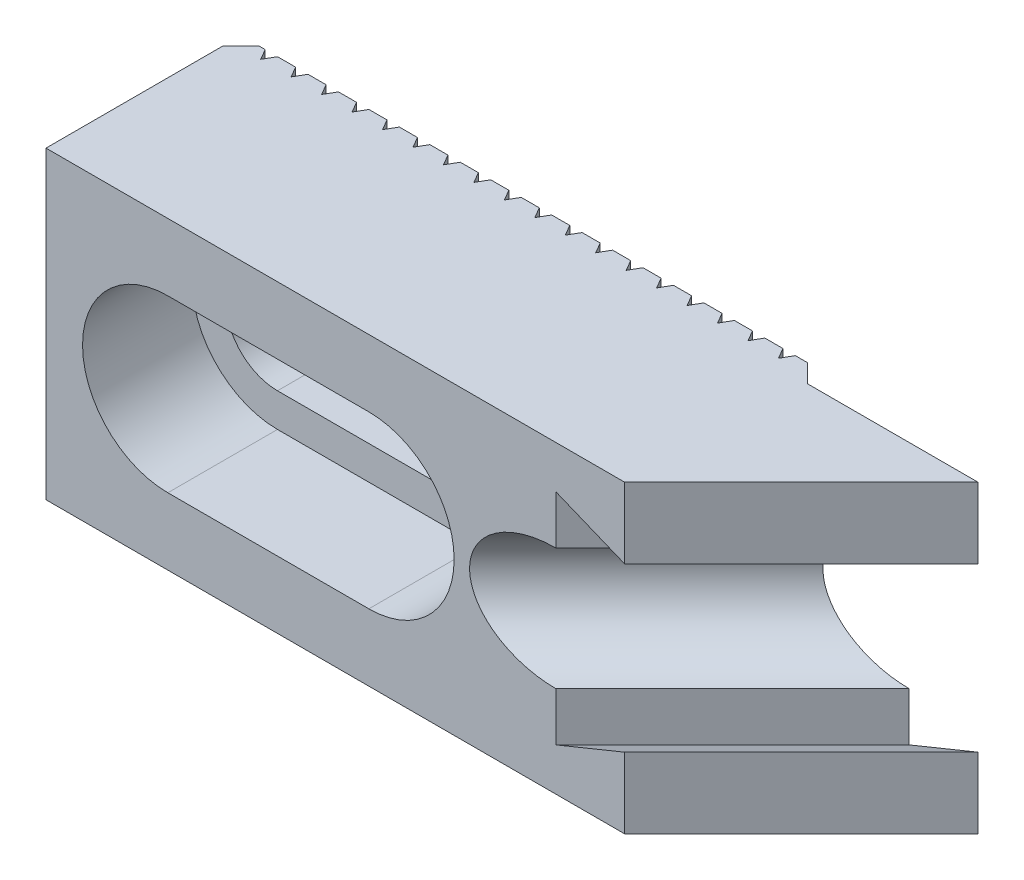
ISO-10303-21;
HEADER;
FILE_DESCRIPTION(('STEP AP214'),'2;1');
FILE_NAME('part.step','',(''),(''),'','','');
FILE_SCHEMA(('AUTOMOTIVE_DESIGN { 1 0 10303 214 1 1 1 1 }'));
ENDSEC;
DATA;
#1=APPLICATION_CONTEXT('core data for automotive mechanical design processes');
#2=APPLICATION_PROTOCOL_DEFINITION('international standard','automotive_design',2000,#1);
#3=PRODUCT_CONTEXT('',#1,'mechanical');
#4=PRODUCT('Part','Part','',(#3));
#5=PRODUCT_RELATED_PRODUCT_CATEGORY('part','',(#4));
#6=PRODUCT_DEFINITION_FORMATION('','',#4);
#7=PRODUCT_DEFINITION_CONTEXT('part definition',#1,'design');
#8=PRODUCT_DEFINITION('design','',#6,#7);
#9=PRODUCT_DEFINITION_SHAPE('','',#8);
#10=(LENGTH_UNIT() NAMED_UNIT(*) SI_UNIT(.MILLI.,.METRE.));
#11=(NAMED_UNIT(*) PLANE_ANGLE_UNIT() SI_UNIT($,.RADIAN.));
#12=(NAMED_UNIT(*) SI_UNIT($,.STERADIAN.) SOLID_ANGLE_UNIT());
#13=UNCERTAINTY_MEASURE_WITH_UNIT(LENGTH_MEASURE(1.E-05),#10,'distance_accuracy_value','');
#14=(GEOMETRIC_REPRESENTATION_CONTEXT(3) GLOBAL_UNCERTAINTY_ASSIGNED_CONTEXT((#13)) GLOBAL_UNIT_ASSIGNED_CONTEXT((#10,
#11,#12)) REPRESENTATION_CONTEXT('',''));
#15=CARTESIAN_POINT('',(0.,0.,0.));
#16=DIRECTION('',(0.,0.,1.));
#17=DIRECTION('',(1.,0.,0.));
#18=AXIS2_PLACEMENT_3D('',#15,#16,#17);
#19=CARTESIAN_POINT('',(35.8492423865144,0.,-4.50609666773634));
#20=DIRECTION('',(-0.707106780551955,0.,0.70710678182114));
#21=DIRECTION('',(0.70710678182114,0.,0.707106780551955));
#22=AXIS2_PLACEMENT_3D('',#19,#20,#21);
#23=CYLINDRICAL_SURFACE('',#22,5.);
#24=CARTESIAN_POINT('',(29.8431457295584,0.,1.5));
#25=DIRECTION('',(0.,0.,1.));
#26=DIRECTION('',(-1.,0.,0.));
#27=AXIS2_PLACEMENT_3D('',#24,#25,#26);
#28=ELLIPSE('',#27,7.07106780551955,5.);
#29=CARTESIAN_POINT('',(29.8431457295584,5.,1.49999999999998));
#30=VERTEX_POINT('',#29);
#31=CARTESIAN_POINT('',(29.8431457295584,-5.,1.49999999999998));
#32=VERTEX_POINT('',#31);
#33=EDGE_CURVE('E1233',#30,#32,#28,.T.);
#34=ORIENTED_EDGE('',*,*,#33,.F.);
#35=DIRECTION('',(-0.707106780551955,0.,0.70710678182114));
#36=VECTOR('',#35,1.);
#37=CARTESIAN_POINT('',(35.8492423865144,5.,-4.50609666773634));
#38=LINE('',#37,#36);
#39=CARTESIAN_POINT('',(15.3431457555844,5.,16.));
#40=VERTEX_POINT('',#39);
#41=EDGE_CURVE('E820',#30,#40,#38,.T.);
#42=ORIENTED_EDGE('',*,*,#41,.T.);
#43=CARTESIAN_POINT('',(15.3431457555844,0.,16.));
#44=DIRECTION('',(0.,0.,1.));
#45=DIRECTION('',(-1.,0.,0.));
#46=AXIS2_PLACEMENT_3D('',#43,#44,#45);
#47=ELLIPSE('',#46,7.07106780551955,5.);
#48=CARTESIAN_POINT('',(15.3431457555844,-5.,16.));
#49=VERTEX_POINT('',#48);
#50=EDGE_CURVE('E822',#40,#49,#47,.T.);
#51=ORIENTED_EDGE('',*,*,#50,.T.);
#52=DIRECTION('',(-0.707106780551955,0.,0.70710678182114));
#53=VECTOR('',#52,1.);
#54=CARTESIAN_POINT('',(35.8492423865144,-5.,-4.50609666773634));
#55=LINE('',#54,#53);
#56=EDGE_CURVE('E818',#32,#49,#55,.T.);
#57=ORIENTED_EDGE('',*,*,#56,.F.);
#58=EDGE_LOOP('',(#34,#42,#51,#57));
#59=FACE_BOUND('',#58,.T.);
#60=ADVANCED_FACE('F14',(#59),#23,.F.);
#61=CARTESIAN_POINT('',(-25.,12.5,0.));
#62=DIRECTION('',(0.,0.,-1.));
#63=DIRECTION('',(-1.,0.,0.));
#64=AXIS2_PLACEMENT_3D('',#61,#62,#63);
#65=PLANE('',#64);
#66=CARTESIAN_POINT('',(0.,0.,0.));
#67=DIRECTION('',(0.,0.,1.));
#68=DIRECTION('',(1.,0.,0.));
#69=AXIS2_PLACEMENT_3D('',#66,#67,#68);
#70=CIRCLE('',#69,4.25);
#71=CARTESIAN_POINT('',(2.9919317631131,3.01841751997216,0.));
#72=VERTEX_POINT('',#71);
#73=CARTESIAN_POINT('',(1.5080682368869,3.97344059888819,0.));
#74=VERTEX_POINT('',#73);
#75=EDGE_CURVE('E1563',#72,#74,#70,.T.);
#76=ORIENTED_EDGE('',*,*,#75,.T.);
#77=DIRECTION('',(0.,1.,0.));
#78=VECTOR('',#77,1.);
#79=CARTESIAN_POINT('',(1.50806823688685,-12.5,0.));
#80=LINE('',#79,#78);
#81=CARTESIAN_POINT('',(1.5080682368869,12.5,0.));
#82=VERTEX_POINT('',#81);
#83=EDGE_CURVE('E965',#74,#82,#80,.T.);
#84=ORIENTED_EDGE('',*,*,#83,.T.);
#85=DIRECTION('',(1.,0.,0.));
#86=VECTOR('',#85,1.);
#87=CARTESIAN_POINT('',(-25.,12.5,0.));
#88=LINE('',#87,#86);
#89=CARTESIAN_POINT('',(2.99193176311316,12.5,0.));
#90=VERTEX_POINT('',#89);
#91=EDGE_CURVE('E1370',#82,#90,#88,.T.);
#92=ORIENTED_EDGE('',*,*,#91,.T.);
#93=DIRECTION('',(0.,1.,0.));
#94=VECTOR('',#93,1.);
#95=CARTESIAN_POINT('',(2.99193176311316,-12.5,0.));
#96=LINE('',#95,#94);
#97=EDGE_CURVE('E946',#72,#90,#96,.T.);
#98=ORIENTED_EDGE('',*,*,#97,.F.);
#99=EDGE_LOOP('',(#76,#84,#92,#98));
#100=FACE_BOUND('',#99,.T.);
#101=ADVANCED_FACE('F1584',(#100),#65,.T.);
#102=CARTESIAN_POINT('',(0.,-4.25,0.));
#103=VERTEX_POINT('',#102);
#104=CARTESIAN_POINT('',(0.491931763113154,-4.22143377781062,0.));
#105=VERTEX_POINT('',#104);
#106=EDGE_CURVE('E699',#103,#105,#70,.T.);
#107=ORIENTED_EDGE('',*,*,#106,.T.);
#108=DIRECTION('',(0.,1.,0.));
#109=VECTOR('',#108,1.);
#110=CARTESIAN_POINT('',(0.491931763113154,-12.5,0.));
#111=LINE('',#110,#109);
#112=CARTESIAN_POINT('',(0.491931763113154,-12.5,0.));
#113=VERTEX_POINT('',#112);
#114=EDGE_CURVE('E970',#113,#105,#111,.T.);
#115=ORIENTED_EDGE('',*,*,#114,.F.);
#116=DIRECTION('',(1.,0.,0.));
#117=VECTOR('',#116,1.);
#118=CARTESIAN_POINT('',(-25.,-12.5,0.));
#119=LINE('',#118,#117);
#120=CARTESIAN_POINT('',(-0.991931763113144,-12.5,0.));
#121=VERTEX_POINT('',#120);
#122=EDGE_CURVE('E1469',#121,#113,#119,.T.);
#123=ORIENTED_EDGE('',*,*,#122,.F.);
#124=DIRECTION('',(0.,1.,0.));
#125=VECTOR('',#124,1.);
#126=CARTESIAN_POINT('',(-0.991931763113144,-12.5,0.));
#127=LINE('',#126,#125);
#128=CARTESIAN_POINT('',(-0.991931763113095,-4.25,0.));
#129=VERTEX_POINT('',#128);
#130=EDGE_CURVE('E989',#121,#129,#127,.T.);
#131=ORIENTED_EDGE('',*,*,#130,.T.);
#132=DIRECTION('',(-1.,0.,0.));
#133=VECTOR('',#132,1.);
#134=CARTESIAN_POINT('',(0.,-4.25,0.));
#135=LINE('',#134,#133);
#136=EDGE_CURVE('E686',#103,#129,#135,.T.);
#137=ORIENTED_EDGE('',*,*,#136,.F.);
#138=EDGE_LOOP('',(#107,#115,#123,#131,#137));
#139=FACE_BOUND('',#138,.T.);
#140=ADVANCED_FACE('F1586',(#139),#65,.T.);
#141=DIRECTION('',(0.,1.,0.));
#142=VECTOR('',#141,1.);
#143=CARTESIAN_POINT('',(-3.49193176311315,-12.5,0.));
#144=LINE('',#143,#142);
#145=CARTESIAN_POINT('',(-3.49193176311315,-12.5,0.));
#146=VERTEX_POINT('',#145);
#147=CARTESIAN_POINT('',(-3.4919317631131,-4.25,0.));
#148=VERTEX_POINT('',#147);
#149=EDGE_CURVE('E1012',#146,#148,#144,.T.);
#150=ORIENTED_EDGE('',*,*,#149,.T.);
#151=CARTESIAN_POINT('',(-2.00806823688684,-4.25,0.));
#152=VERTEX_POINT('',#151);
#153=EDGE_CURVE('E688',#152,#148,#135,.T.);
#154=ORIENTED_EDGE('',*,*,#153,.F.);
#155=DIRECTION('',(0.,1.,0.));
#156=VECTOR('',#155,1.);
#157=CARTESIAN_POINT('',(-2.00806823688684,-12.5,0.));
#158=LINE('',#157,#156);
#159=CARTESIAN_POINT('',(-2.00806823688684,-12.5,0.));
#160=VERTEX_POINT('',#159);
#161=EDGE_CURVE('E993',#160,#152,#158,.T.);
#162=ORIENTED_EDGE('',*,*,#161,.F.);
#163=EDGE_CURVE('E1465',#146,#160,#119,.T.);
#164=ORIENTED_EDGE('',*,*,#163,.F.);
#165=EDGE_LOOP('',(#150,#154,#162,#164));
#166=FACE_BOUND('',#165,.T.);
#167=ADVANCED_FACE('F1595',(#166),#65,.T.);
#168=CARTESIAN_POINT('',(-2.00806823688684,4.25,0.));
#169=VERTEX_POINT('',#168);
#170=CARTESIAN_POINT('',(-2.00806823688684,12.5,0.));
#171=VERTEX_POINT('',#170);
#172=EDGE_CURVE('E992',#169,#171,#158,.T.);
#173=ORIENTED_EDGE('',*,*,#172,.F.);
#174=DIRECTION('',(1.,0.,0.));
#175=VECTOR('',#174,1.);
#176=CARTESIAN_POINT('',(-16.5,4.25,0.));
#177=LINE('',#176,#175);
#178=CARTESIAN_POINT('',(-3.4919317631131,4.25,0.));
#179=VERTEX_POINT('',#178);
#180=EDGE_CURVE('E698',#179,#169,#177,.T.);
#181=ORIENTED_EDGE('',*,*,#180,.F.);
#182=CARTESIAN_POINT('',(-3.49193176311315,12.5,0.));
#183=VERTEX_POINT('',#182);
#184=EDGE_CURVE('E1011',#179,#183,#144,.T.);
#185=ORIENTED_EDGE('',*,*,#184,.T.);
#186=EDGE_CURVE('E1380',#183,#171,#88,.T.);
#187=ORIENTED_EDGE('',*,*,#186,.T.);
#188=EDGE_LOOP('',(#173,#181,#185,#187));
#189=FACE_BOUND('',#188,.T.);
#190=ADVANCED_FACE('F1712',(#189),#65,.T.);
#191=DIRECTION('',(0.,1.,0.));
#192=VECTOR('',#191,1.);
#193=CARTESIAN_POINT('',(-5.99193176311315,-12.5,0.));
#194=LINE('',#193,#192);
#195=CARTESIAN_POINT('',(-5.99193176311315,-12.5,0.));
#196=VERTEX_POINT('',#195);
#197=CARTESIAN_POINT('',(-5.9919317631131,-4.25,0.));
#198=VERTEX_POINT('',#197);
#199=EDGE_CURVE('E1035',#196,#198,#194,.T.);
#200=ORIENTED_EDGE('',*,*,#199,.T.);
#201=CARTESIAN_POINT('',(-4.50806823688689,-4.25,0.));
#202=VERTEX_POINT('',#201);
#203=EDGE_CURVE('E2479',#202,#198,#135,.T.);
#204=ORIENTED_EDGE('',*,*,#203,.F.);
#205=DIRECTION('',(0.,1.,0.));
#206=VECTOR('',#205,1.);
#207=CARTESIAN_POINT('',(-4.50806823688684,-12.5,0.));
#208=LINE('',#207,#206);
#209=CARTESIAN_POINT('',(-4.50806823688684,-12.5,0.));
#210=VERTEX_POINT('',#209);
#211=EDGE_CURVE('E1016',#210,#202,#208,.T.);
#212=ORIENTED_EDGE('',*,*,#211,.F.);
#213=EDGE_CURVE('E1461',#196,#210,#119,.T.);
#214=ORIENTED_EDGE('',*,*,#213,.F.);
#215=EDGE_LOOP('',(#200,#204,#212,#214));
#216=FACE_BOUND('',#215,.T.);
#217=ADVANCED_FACE('F1719',(#216),#65,.T.);
#218=CARTESIAN_POINT('',(-4.50806823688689,4.25,0.));
#219=VERTEX_POINT('',#218);
#220=CARTESIAN_POINT('',(-4.50806823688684,12.5,0.));
#221=VERTEX_POINT('',#220);
#222=EDGE_CURVE('E1015',#219,#221,#208,.T.);
#223=ORIENTED_EDGE('',*,*,#222,.F.);
#224=CARTESIAN_POINT('',(-5.9919317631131,4.25,0.));
#225=VERTEX_POINT('',#224);
#226=EDGE_CURVE('E2517',#225,#219,#177,.T.);
#227=ORIENTED_EDGE('',*,*,#226,.F.);
#228=CARTESIAN_POINT('',(-5.9919317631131,12.5,0.));
#229=VERTEX_POINT('',#228);
#230=EDGE_CURVE('E1034',#225,#229,#194,.T.);
#231=ORIENTED_EDGE('',*,*,#230,.T.);
#232=EDGE_CURVE('E1385',#229,#221,#88,.T.);
#233=ORIENTED_EDGE('',*,*,#232,.T.);
#234=EDGE_LOOP('',(#223,#227,#231,#233));
#235=FACE_BOUND('',#234,.T.);
#236=ADVANCED_FACE('F1726',(#235),#65,.T.);
#237=DIRECTION('',(0.,1.,0.));
#238=VECTOR('',#237,1.);
#239=CARTESIAN_POINT('',(-8.49193176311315,-12.5,0.));
#240=LINE('',#239,#238);
#241=CARTESIAN_POINT('',(-8.49193176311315,-12.5,0.));
#242=VERTEX_POINT('',#241);
#243=CARTESIAN_POINT('',(-8.4919317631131,-4.25,0.));
#244=VERTEX_POINT('',#243);
#245=EDGE_CURVE('E1058',#242,#244,#240,.T.);
#246=ORIENTED_EDGE('',*,*,#245,.T.);
#247=CARTESIAN_POINT('',(-7.00806823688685,-4.25,0.));
#248=VERTEX_POINT('',#247);
#249=EDGE_CURVE('E2476',#248,#244,#135,.T.);
#250=ORIENTED_EDGE('',*,*,#249,.F.);
#251=DIRECTION('',(0.,1.,0.));
#252=VECTOR('',#251,1.);
#253=CARTESIAN_POINT('',(-7.00806823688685,-12.5,0.));
#254=LINE('',#253,#252);
#255=CARTESIAN_POINT('',(-7.00806823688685,-12.5,0.));
#256=VERTEX_POINT('',#255);
#257=EDGE_CURVE('E1039',#256,#248,#254,.T.);
#258=ORIENTED_EDGE('',*,*,#257,.F.);
#259=EDGE_CURVE('E1457',#242,#256,#119,.T.);
#260=ORIENTED_EDGE('',*,*,#259,.F.);
#261=EDGE_LOOP('',(#246,#250,#258,#260));
#262=FACE_BOUND('',#261,.T.);
#263=ADVANCED_FACE('F1734',(#262),#65,.T.);
#264=CARTESIAN_POINT('',(-7.00806823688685,4.25,0.));
#265=VERTEX_POINT('',#264);
#266=CARTESIAN_POINT('',(-7.00806823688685,12.5,0.));
#267=VERTEX_POINT('',#266);
#268=EDGE_CURVE('E1038',#265,#267,#254,.T.);
#269=ORIENTED_EDGE('',*,*,#268,.F.);
#270=CARTESIAN_POINT('',(-8.4919317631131,4.25,0.));
#271=VERTEX_POINT('',#270);
#272=EDGE_CURVE('E2515',#271,#265,#177,.T.);
#273=ORIENTED_EDGE('',*,*,#272,.F.);
#274=CARTESIAN_POINT('',(-8.49193176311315,12.5,0.));
#275=VERTEX_POINT('',#274);
#276=EDGE_CURVE('E1057',#271,#275,#240,.T.);
#277=ORIENTED_EDGE('',*,*,#276,.T.);
#278=EDGE_CURVE('E1390',#275,#267,#88,.T.);
#279=ORIENTED_EDGE('',*,*,#278,.T.);
#280=EDGE_LOOP('',(#269,#273,#277,#279));
#281=FACE_BOUND('',#280,.T.);
#282=ADVANCED_FACE('F1741',(#281),#65,.T.);
#283=DIRECTION('',(0.,1.,0.));
#284=VECTOR('',#283,1.);
#285=CARTESIAN_POINT('',(-10.9919317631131,-12.5,0.));
#286=LINE('',#285,#284);
#287=CARTESIAN_POINT('',(-10.9919317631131,-12.5,0.));
#288=VERTEX_POINT('',#287);
#289=CARTESIAN_POINT('',(-10.9919317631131,-4.25,0.));
#290=VERTEX_POINT('',#289);
#291=EDGE_CURVE('E1081',#288,#290,#286,.T.);
#292=ORIENTED_EDGE('',*,*,#291,.T.);
#293=CARTESIAN_POINT('',(-9.5080682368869,-4.25,0.));
#294=VERTEX_POINT('',#293);
#295=EDGE_CURVE('E2473',#294,#290,#135,.T.);
#296=ORIENTED_EDGE('',*,*,#295,.F.);
#297=DIRECTION('',(0.,1.,0.));
#298=VECTOR('',#297,1.);
#299=CARTESIAN_POINT('',(-9.50806823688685,-12.5,0.));
#300=LINE('',#299,#298);
#301=CARTESIAN_POINT('',(-9.50806823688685,-12.5,0.));
#302=VERTEX_POINT('',#301);
#303=EDGE_CURVE('E1062',#302,#294,#300,.T.);
#304=ORIENTED_EDGE('',*,*,#303,.F.);
#305=EDGE_CURVE('E1453',#288,#302,#119,.T.);
#306=ORIENTED_EDGE('',*,*,#305,.F.);
#307=EDGE_LOOP('',(#292,#296,#304,#306));
#308=FACE_BOUND('',#307,.T.);
#309=ADVANCED_FACE('F1749',(#308),#65,.T.);
#310=CARTESIAN_POINT('',(-9.5080682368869,4.25,0.));
#311=VERTEX_POINT('',#310);
#312=CARTESIAN_POINT('',(-9.50806823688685,12.5,0.));
#313=VERTEX_POINT('',#312);
#314=EDGE_CURVE('E1061',#311,#313,#300,.T.);
#315=ORIENTED_EDGE('',*,*,#314,.F.);
#316=CARTESIAN_POINT('',(-10.9919317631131,4.25,0.));
#317=VERTEX_POINT('',#316);
#318=EDGE_CURVE('E2513',#317,#311,#177,.T.);
#319=ORIENTED_EDGE('',*,*,#318,.F.);
#320=CARTESIAN_POINT('',(-10.9919317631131,12.5,0.));
#321=VERTEX_POINT('',#320);
#322=EDGE_CURVE('E1080',#317,#321,#286,.T.);
#323=ORIENTED_EDGE('',*,*,#322,.T.);
#324=EDGE_CURVE('E1395',#321,#313,#88,.T.);
#325=ORIENTED_EDGE('',*,*,#324,.T.);
#326=EDGE_LOOP('',(#315,#319,#323,#325));
#327=FACE_BOUND('',#326,.T.);
#328=ADVANCED_FACE('F1756',(#327),#65,.T.);
#329=DIRECTION('',(0.,1.,0.));
#330=VECTOR('',#329,1.);
#331=CARTESIAN_POINT('',(-13.4919317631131,-12.5,0.));
#332=LINE('',#331,#330);
#333=CARTESIAN_POINT('',(-13.4919317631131,-12.5,0.));
#334=VERTEX_POINT('',#333);
#335=CARTESIAN_POINT('',(-13.4919317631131,-4.25,0.));
#336=VERTEX_POINT('',#335);
#337=EDGE_CURVE('E1104',#334,#336,#332,.T.);
#338=ORIENTED_EDGE('',*,*,#337,.T.);
#339=CARTESIAN_POINT('',(-12.0080682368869,-4.25,0.));
#340=VERTEX_POINT('',#339);
#341=EDGE_CURVE('E2472',#340,#336,#135,.T.);
#342=ORIENTED_EDGE('',*,*,#341,.F.);
#343=DIRECTION('',(0.,1.,0.));
#344=VECTOR('',#343,1.);
#345=CARTESIAN_POINT('',(-12.0080682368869,-12.5,0.));
#346=LINE('',#345,#344);
#347=CARTESIAN_POINT('',(-12.0080682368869,-12.5,0.));
#348=VERTEX_POINT('',#347);
#349=EDGE_CURVE('E1085',#348,#340,#346,.T.);
#350=ORIENTED_EDGE('',*,*,#349,.F.);
#351=EDGE_CURVE('E1449',#334,#348,#119,.T.);
#352=ORIENTED_EDGE('',*,*,#351,.F.);
#353=EDGE_LOOP('',(#338,#342,#350,#352));
#354=FACE_BOUND('',#353,.T.);
#355=ADVANCED_FACE('F1764',(#354),#65,.T.);
#356=CARTESIAN_POINT('',(-12.0080682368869,4.25,0.));
#357=VERTEX_POINT('',#356);
#358=CARTESIAN_POINT('',(-12.0080682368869,12.5,0.));
#359=VERTEX_POINT('',#358);
#360=EDGE_CURVE('E1084',#357,#359,#346,.T.);
#361=ORIENTED_EDGE('',*,*,#360,.F.);
#362=CARTESIAN_POINT('',(-13.4919317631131,4.25,0.));
#363=VERTEX_POINT('',#362);
#364=EDGE_CURVE('E2512',#363,#357,#177,.T.);
#365=ORIENTED_EDGE('',*,*,#364,.F.);
#366=CARTESIAN_POINT('',(-13.4919317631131,12.5,0.));
#367=VERTEX_POINT('',#366);
#368=EDGE_CURVE('E1103',#363,#367,#332,.T.);
#369=ORIENTED_EDGE('',*,*,#368,.T.);
#370=EDGE_CURVE('E1400',#367,#359,#88,.T.);
#371=ORIENTED_EDGE('',*,*,#370,.T.);
#372=EDGE_LOOP('',(#361,#365,#369,#371));
#373=FACE_BOUND('',#372,.T.);
#374=ADVANCED_FACE('F1771',(#373),#65,.T.);
#375=DIRECTION('',(0.,1.,0.));
#376=VECTOR('',#375,1.);
#377=CARTESIAN_POINT('',(-15.9919317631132,-12.5,0.));
#378=LINE('',#377,#376);
#379=CARTESIAN_POINT('',(-15.9919317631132,-12.5,0.));
#380=VERTEX_POINT('',#379);
#381=CARTESIAN_POINT('',(-15.9919317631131,-4.25,0.));
#382=VERTEX_POINT('',#381);
#383=EDGE_CURVE('E1127',#380,#382,#378,.T.);
#384=ORIENTED_EDGE('',*,*,#383,.T.);
#385=CARTESIAN_POINT('',(-14.5080682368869,-4.25,0.));
#386=VERTEX_POINT('',#385);
#387=EDGE_CURVE('E689',#386,#382,#135,.T.);
#388=ORIENTED_EDGE('',*,*,#387,.F.);
#389=DIRECTION('',(0.,1.,0.));
#390=VECTOR('',#389,1.);
#391=CARTESIAN_POINT('',(-14.5080682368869,-12.5,0.));
#392=LINE('',#391,#390);
#393=CARTESIAN_POINT('',(-14.5080682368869,-12.5,0.));
#394=VERTEX_POINT('',#393);
#395=EDGE_CURVE('E1108',#394,#386,#392,.T.);
#396=ORIENTED_EDGE('',*,*,#395,.F.);
#397=EDGE_CURVE('E1445',#380,#394,#119,.T.);
#398=ORIENTED_EDGE('',*,*,#397,.F.);
#399=EDGE_LOOP('',(#384,#388,#396,#398));
#400=FACE_BOUND('',#399,.T.);
#401=ADVANCED_FACE('F1779',(#400),#65,.T.);
#402=CARTESIAN_POINT('',(-14.5080682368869,4.25,0.));
#403=VERTEX_POINT('',#402);
#404=CARTESIAN_POINT('',(-14.5080682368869,12.5,0.));
#405=VERTEX_POINT('',#404);
#406=EDGE_CURVE('E1107',#403,#405,#392,.T.);
#407=ORIENTED_EDGE('',*,*,#406,.F.);
#408=CARTESIAN_POINT('',(-15.9919317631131,4.25,0.));
#409=VERTEX_POINT('',#408);
#410=EDGE_CURVE('E694',#409,#403,#177,.T.);
#411=ORIENTED_EDGE('',*,*,#410,.F.);
#412=CARTESIAN_POINT('',(-15.9919317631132,12.5,0.));
#413=VERTEX_POINT('',#412);
#414=EDGE_CURVE('E1126',#409,#413,#378,.T.);
#415=ORIENTED_EDGE('',*,*,#414,.T.);
#416=EDGE_CURVE('E1405',#413,#405,#88,.T.);
#417=ORIENTED_EDGE('',*,*,#416,.T.);
#418=EDGE_LOOP('',(#407,#411,#415,#417));
#419=FACE_BOUND('',#418,.T.);
#420=ADVANCED_FACE('F1786',(#419),#65,.T.);
#421=CARTESIAN_POINT('',(-16.5,0.,0.));
#422=DIRECTION('',(0.,0.,1.));
#423=DIRECTION('',(1.,0.,0.));
#424=AXIS2_PLACEMENT_3D('',#421,#422,#423);
#425=CIRCLE('',#424,4.25);
#426=CARTESIAN_POINT('',(-17.0080682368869,4.21952208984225,0.));
#427=VERTEX_POINT('',#426);
#428=CARTESIAN_POINT('',(-18.4919317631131,3.75429192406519,0.));
#429=VERTEX_POINT('',#428);
#430=EDGE_CURVE('E695',#427,#429,#425,.T.);
#431=ORIENTED_EDGE('',*,*,#430,.T.);
#432=DIRECTION('',(0.,1.,0.));
#433=VECTOR('',#432,1.);
#434=CARTESIAN_POINT('',(-18.4919317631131,-12.5,0.));
#435=LINE('',#434,#433);
#436=CARTESIAN_POINT('',(-18.4919317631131,12.5,0.));
#437=VERTEX_POINT('',#436);
#438=EDGE_CURVE('E1149',#429,#437,#435,.T.);
#439=ORIENTED_EDGE('',*,*,#438,.T.);
#440=CARTESIAN_POINT('',(-17.0080682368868,12.5,0.));
#441=VERTEX_POINT('',#440);
#442=EDGE_CURVE('E1410',#437,#441,#88,.T.);
#443=ORIENTED_EDGE('',*,*,#442,.T.);
#444=DIRECTION('',(0.,1.,0.));
#445=VECTOR('',#444,1.);
#446=CARTESIAN_POINT('',(-17.0080682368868,-12.5,0.));
#447=LINE('',#446,#445);
#448=EDGE_CURVE('E1130',#427,#441,#447,.T.);
#449=ORIENTED_EDGE('',*,*,#448,.F.);
#450=EDGE_LOOP('',(#431,#439,#443,#449));
#451=FACE_BOUND('',#450,.T.);
#452=ADVANCED_FACE('F1794',(#451),#65,.T.);
#453=CARTESIAN_POINT('',(-19.,-12.5,0.87999999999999));
#454=DIRECTION('',(0.866025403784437,0.,-0.5));
#455=DIRECTION('',(-0.5,0.,-0.866025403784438));
#456=AXIS2_PLACEMENT_3D('',#453,#454,#455);
#457=PLANE('',#456);
#458=CARTESIAN_POINT('',(-16.5,0.,5.21012701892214));
#459=DIRECTION('',(0.866025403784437,0.,-0.5));
#460=DIRECTION('',(0.5,0.,0.866025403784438));
#461=AXIS2_PLACEMENT_3D('',#458,#459,#460);
#462=ELLIPSE('',#461,8.5,4.25);
#463=CARTESIAN_POINT('',(-19.,-3.43693177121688,0.87999999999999));
#464=VERTEX_POINT('',#463);
#465=CARTESIAN_POINT('',(-19.5080682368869,-3.00233667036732,0.));
#466=VERTEX_POINT('',#465);
#467=EDGE_CURVE('E785',#464,#466,#462,.T.);
#468=ORIENTED_EDGE('',*,*,#467,.F.);
#469=DIRECTION('',(0.,1.,0.));
#470=VECTOR('',#469,1.);
#471=CARTESIAN_POINT('',(-19.,-12.5,0.87999999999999));
#472=LINE('',#471,#470);
#473=CARTESIAN_POINT('',(-19.,-12.5,0.87999999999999));
#474=VERTEX_POINT('',#473);
#475=EDGE_CURVE('E1146',#474,#464,#472,.T.);
#476=ORIENTED_EDGE('',*,*,#475,.F.);
#477=DIRECTION('',(-0.5,0.,-0.866025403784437));
#478=VECTOR('',#477,1.);
#479=CARTESIAN_POINT('',(-19.,-12.5,0.87999999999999));
#480=LINE('',#479,#478);
#481=CARTESIAN_POINT('',(-19.5080682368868,-12.5,0.));
#482=VERTEX_POINT('',#481);
#483=EDGE_CURVE('E1138',#474,#482,#480,.T.);
#484=ORIENTED_EDGE('',*,*,#483,.T.);
#485=DIRECTION('',(0.,1.,0.));
#486=VECTOR('',#485,1.);
#487=CARTESIAN_POINT('',(-19.5080682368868,-12.5,0.));
#488=LINE('',#487,#486);
#489=EDGE_CURVE('E1154',#482,#466,#488,.T.);
#490=ORIENTED_EDGE('',*,*,#489,.T.);
#491=EDGE_LOOP('',(#468,#476,#484,#490));
#492=FACE_BOUND('',#491,.T.);
#493=ADVANCED_FACE('F1801',(#492),#457,.T.);
#494=CARTESIAN_POINT('',(-19.,-12.5,0.87999999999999));
#495=DIRECTION('',(0.866025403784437,0.,0.5));
#496=DIRECTION('',(0.5,0.,-0.866025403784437));
#497=AXIS2_PLACEMENT_3D('',#494,#495,#496);
#498=PLANE('',#497);
#499=ORIENTED_EDGE('',*,*,#475,.T.);
#500=CARTESIAN_POINT('',(-16.5,0.,-3.45012701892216));
#501=DIRECTION('',(0.866025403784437,0.,0.5));
#502=DIRECTION('',(-0.5,0.,0.866025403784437));
#503=AXIS2_PLACEMENT_3D('',#500,#501,#502);
#504=ELLIPSE('',#503,8.5,4.25);
#505=CARTESIAN_POINT('',(-18.4919317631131,-3.75429192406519,0.));
#506=VERTEX_POINT('',#505);
#507=EDGE_CURVE('E783',#464,#506,#504,.T.);
#508=ORIENTED_EDGE('',*,*,#507,.T.);
#509=CARTESIAN_POINT('',(-18.4919317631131,-12.5,0.));
#510=VERTEX_POINT('',#509);
#511=EDGE_CURVE('E1150',#510,#506,#435,.T.);
#512=ORIENTED_EDGE('',*,*,#511,.F.);
#513=DIRECTION('',(0.5,0.,-0.866025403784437));
#514=VECTOR('',#513,1.);
#515=CARTESIAN_POINT('',(-19.,-12.5,0.87999999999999));
#516=LINE('',#515,#514);
#517=EDGE_CURVE('E1141',#474,#510,#516,.T.);
#518=ORIENTED_EDGE('',*,*,#517,.F.);
#519=EDGE_LOOP('',(#499,#508,#512,#518));
#520=FACE_BOUND('',#519,.T.);
#521=ADVANCED_FACE('F1808',(#520),#498,.F.);
#522=CARTESIAN_POINT('',(-16.5,-12.5,0.87999999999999));
#523=DIRECTION('',(0.866025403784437,0.,-0.5));
#524=DIRECTION('',(-0.5,0.,-0.866025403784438));
#525=AXIS2_PLACEMENT_3D('',#522,#523,#524);
#526=PLANE('',#525);
#527=CARTESIAN_POINT('',(-16.5,0.,0.879999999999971));
#528=DIRECTION('',(0.866025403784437,0.,-0.5));
#529=DIRECTION('',(0.5,0.,0.866025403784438));
#530=AXIS2_PLACEMENT_3D('',#527,#528,#529);
#531=ELLIPSE('',#530,8.5,4.25);
#532=CARTESIAN_POINT('',(-16.5,-4.25,0.87999999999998));
#533=VERTEX_POINT('',#532);
#534=CARTESIAN_POINT('',(-17.0080682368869,-4.21952208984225,0.));
#535=VERTEX_POINT('',#534);
#536=EDGE_CURVE('E778',#533,#535,#531,.T.);
#537=ORIENTED_EDGE('',*,*,#536,.F.);
#538=DIRECTION('',(0.,1.,0.));
#539=VECTOR('',#538,1.);
#540=CARTESIAN_POINT('',(-16.5,-12.5,0.87999999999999));
#541=LINE('',#540,#539);
#542=CARTESIAN_POINT('',(-16.5,-12.5,0.87999999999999));
#543=VERTEX_POINT('',#542);
#544=EDGE_CURVE('E1123',#543,#533,#541,.T.);
#545=ORIENTED_EDGE('',*,*,#544,.F.);
#546=DIRECTION('',(-0.5,0.,-0.866025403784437));
#547=VECTOR('',#546,1.);
#548=CARTESIAN_POINT('',(-16.5,-12.5,0.87999999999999));
#549=LINE('',#548,#547);
#550=CARTESIAN_POINT('',(-17.0080682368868,-12.5,0.));
#551=VERTEX_POINT('',#550);
#552=EDGE_CURVE('E1115',#543,#551,#549,.T.);
#553=ORIENTED_EDGE('',*,*,#552,.T.);
#554=EDGE_CURVE('E1131',#551,#535,#447,.T.);
#555=ORIENTED_EDGE('',*,*,#554,.T.);
#556=EDGE_LOOP('',(#537,#545,#553,#555));
#557=FACE_BOUND('',#556,.T.);
#558=ADVANCED_FACE('F1818',(#557),#526,.T.);
#559=CARTESIAN_POINT('',(-16.5,-12.5,0.87999999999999));
#560=DIRECTION('',(0.866025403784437,0.,0.5));
#561=DIRECTION('',(0.5,0.,-0.866025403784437));
#562=AXIS2_PLACEMENT_3D('',#559,#560,#561);
#563=PLANE('',#562);
#564=DIRECTION('',(-0.5,0.,0.866025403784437));
#565=VECTOR('',#564,1.);
#566=CARTESIAN_POINT('',(-16.5,-4.25,0.87999999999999));
#567=LINE('',#566,#565);
#568=EDGE_CURVE('E775',#382,#533,#567,.T.);
#569=ORIENTED_EDGE('',*,*,#568,.F.);
#570=ORIENTED_EDGE('',*,*,#383,.F.);
#571=DIRECTION('',(0.5,0.,-0.866025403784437));
#572=VECTOR('',#571,1.);
#573=CARTESIAN_POINT('',(-16.5,-12.5,0.87999999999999));
#574=LINE('',#573,#572);
#575=EDGE_CURVE('E1118',#543,#380,#574,.T.);
#576=ORIENTED_EDGE('',*,*,#575,.F.);
#577=ORIENTED_EDGE('',*,*,#544,.T.);
#578=EDGE_LOOP('',(#569,#570,#576,#577));
#579=FACE_BOUND('',#578,.T.);
#580=ADVANCED_FACE('F1828',(#579),#563,.F.);
#581=DIRECTION('',(0.5,0.,-0.866025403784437));
#582=VECTOR('',#581,1.);
#583=CARTESIAN_POINT('',(-16.5,4.25,0.87999999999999));
#584=LINE('',#583,#582);
#585=CARTESIAN_POINT('',(-16.5,4.25,0.87999999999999));
#586=VERTEX_POINT('',#585);
#587=EDGE_CURVE('E745',#586,#409,#584,.T.);
#588=ORIENTED_EDGE('',*,*,#587,.F.);
#589=CARTESIAN_POINT('',(-16.5,12.5,0.87999999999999));
#590=VERTEX_POINT('',#589);
#591=EDGE_CURVE('E1121',#586,#590,#541,.T.);
#592=ORIENTED_EDGE('',*,*,#591,.T.);
#593=DIRECTION('',(0.5,0.,-0.866025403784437));
#594=VECTOR('',#593,1.);
#595=CARTESIAN_POINT('',(-16.5,12.5,0.87999999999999));
#596=LINE('',#595,#594);
#597=EDGE_CURVE('E1112',#590,#413,#596,.T.);
#598=ORIENTED_EDGE('',*,*,#597,.T.);
#599=ORIENTED_EDGE('',*,*,#414,.F.);
#600=EDGE_LOOP('',(#588,#592,#598,#599));
#601=FACE_BOUND('',#600,.T.);
#602=ADVANCED_FACE('F1838',(#601),#563,.F.);
#603=CARTESIAN_POINT('',(-14.,-12.5,0.87999999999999));
#604=DIRECTION('',(0.866025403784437,0.,-0.5));
#605=DIRECTION('',(-0.5,0.,-0.866025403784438));
#606=AXIS2_PLACEMENT_3D('',#603,#604,#605);
#607=PLANE('',#606);
#608=ORIENTED_EDGE('',*,*,#395,.T.);
#609=DIRECTION('',(0.5,0.,0.866025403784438));
#610=VECTOR('',#609,1.);
#611=CARTESIAN_POINT('',(-14.,-4.25,0.87999999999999));
#612=LINE('',#611,#610);
#613=CARTESIAN_POINT('',(-14.,-4.25,0.87999999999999));
#614=VERTEX_POINT('',#613);
#615=EDGE_CURVE('E772',#386,#614,#612,.T.);
#616=ORIENTED_EDGE('',*,*,#615,.T.);
#617=DIRECTION('',(0.,1.,0.));
#618=VECTOR('',#617,1.);
#619=CARTESIAN_POINT('',(-14.,-12.5,0.87999999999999));
#620=LINE('',#619,#618);
#621=CARTESIAN_POINT('',(-14.,-12.5,0.87999999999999));
#622=VERTEX_POINT('',#621);
#623=EDGE_CURVE('E1100',#622,#614,#620,.T.);
#624=ORIENTED_EDGE('',*,*,#623,.F.);
#625=DIRECTION('',(-0.5,0.,-0.866025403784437));
#626=VECTOR('',#625,1.);
#627=CARTESIAN_POINT('',(-14.,-12.5,0.87999999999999));
#628=LINE('',#627,#626);
#629=EDGE_CURVE('E1092',#622,#394,#628,.T.);
#630=ORIENTED_EDGE('',*,*,#629,.T.);
#631=EDGE_LOOP('',(#608,#616,#624,#630));
#632=FACE_BOUND('',#631,.T.);
#633=ADVANCED_FACE('F1847',(#632),#607,.T.);
#634=CARTESIAN_POINT('',(-14.,4.25,0.87999999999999));
#635=VERTEX_POINT('',#634);
#636=CARTESIAN_POINT('',(-14.,12.5,0.87999999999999));
#637=VERTEX_POINT('',#636);
#638=EDGE_CURVE('E1098',#635,#637,#620,.T.);
#639=ORIENTED_EDGE('',*,*,#638,.F.);
#640=DIRECTION('',(-0.5,0.,-0.866025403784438));
#641=VECTOR('',#640,1.);
#642=CARTESIAN_POINT('',(-14.,4.25,0.87999999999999));
#643=LINE('',#642,#641);
#644=EDGE_CURVE('E742',#635,#403,#643,.T.);
#645=ORIENTED_EDGE('',*,*,#644,.T.);
#646=ORIENTED_EDGE('',*,*,#406,.T.);
#647=DIRECTION('',(-0.5,0.,-0.866025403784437));
#648=VECTOR('',#647,1.);
#649=CARTESIAN_POINT('',(-14.,12.5,0.87999999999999));
#650=LINE('',#649,#648);
#651=EDGE_CURVE('E1088',#637,#405,#650,.T.);
#652=ORIENTED_EDGE('',*,*,#651,.F.);
#653=EDGE_LOOP('',(#639,#645,#646,#652));
#654=FACE_BOUND('',#653,.T.);
#655=ADVANCED_FACE('F1855',(#654),#607,.T.);
#656=CARTESIAN_POINT('',(-14.,-12.5,0.87999999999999));
#657=DIRECTION('',(0.866025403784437,0.,0.5));
#658=DIRECTION('',(0.5,0.,-0.866025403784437));
#659=AXIS2_PLACEMENT_3D('',#656,#657,#658);
#660=PLANE('',#659);
#661=DIRECTION('',(-0.5,0.,0.866025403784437));
#662=VECTOR('',#661,1.);
#663=CARTESIAN_POINT('',(-14.,-4.25,0.87999999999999));
#664=LINE('',#663,#662);
#665=EDGE_CURVE('E770',#336,#614,#664,.T.);
#666=ORIENTED_EDGE('',*,*,#665,.F.);
#667=ORIENTED_EDGE('',*,*,#337,.F.);
#668=DIRECTION('',(0.5,0.,-0.866025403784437));
#669=VECTOR('',#668,1.);
#670=CARTESIAN_POINT('',(-14.,-12.5,0.87999999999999));
#671=LINE('',#670,#669);
#672=EDGE_CURVE('E1095',#622,#334,#671,.T.);
#673=ORIENTED_EDGE('',*,*,#672,.F.);
#674=ORIENTED_EDGE('',*,*,#623,.T.);
#675=EDGE_LOOP('',(#666,#667,#673,#674));
#676=FACE_BOUND('',#675,.T.);
#677=ADVANCED_FACE('F1864',(#676),#660,.F.);
#678=DIRECTION('',(0.5,0.,-0.866025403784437));
#679=VECTOR('',#678,1.);
#680=CARTESIAN_POINT('',(-14.,4.25,0.87999999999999));
#681=LINE('',#680,#679);
#682=EDGE_CURVE('E740',#635,#363,#681,.T.);
#683=ORIENTED_EDGE('',*,*,#682,.F.);
#684=ORIENTED_EDGE('',*,*,#638,.T.);
#685=DIRECTION('',(0.5,0.,-0.866025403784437));
#686=VECTOR('',#685,1.);
#687=CARTESIAN_POINT('',(-14.,12.5,0.87999999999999));
#688=LINE('',#687,#686);
#689=EDGE_CURVE('E1089',#637,#367,#688,.T.);
#690=ORIENTED_EDGE('',*,*,#689,.T.);
#691=ORIENTED_EDGE('',*,*,#368,.F.);
#692=EDGE_LOOP('',(#683,#684,#690,#691));
#693=FACE_BOUND('',#692,.T.);
#694=ADVANCED_FACE('F1872',(#693),#660,.F.);
#695=CARTESIAN_POINT('',(-11.5,-12.5,0.88));
#696=DIRECTION('',(0.866025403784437,0.,-0.5));
#697=DIRECTION('',(-0.5,0.,-0.866025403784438));
#698=AXIS2_PLACEMENT_3D('',#695,#696,#697);
#699=PLANE('',#698);
#700=ORIENTED_EDGE('',*,*,#349,.T.);
#701=DIRECTION('',(0.5,0.,0.866025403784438));
#702=VECTOR('',#701,1.);
#703=CARTESIAN_POINT('',(-11.5,-4.25,0.88));
#704=LINE('',#703,#702);
#705=CARTESIAN_POINT('',(-11.5,-4.25,0.88));
#706=VERTEX_POINT('',#705);
#707=EDGE_CURVE('E767',#340,#706,#704,.T.);
#708=ORIENTED_EDGE('',*,*,#707,.T.);
#709=DIRECTION('',(0.,1.,0.));
#710=VECTOR('',#709,1.);
#711=CARTESIAN_POINT('',(-11.5,-12.5,0.88));
#712=LINE('',#711,#710);
#713=CARTESIAN_POINT('',(-11.5,-12.5,0.88));
#714=VERTEX_POINT('',#713);
#715=EDGE_CURVE('E1077',#714,#706,#712,.T.);
#716=ORIENTED_EDGE('',*,*,#715,.F.);
#717=DIRECTION('',(-0.5,0.,-0.866025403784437));
#718=VECTOR('',#717,1.);
#719=CARTESIAN_POINT('',(-11.5,-12.5,0.88));
#720=LINE('',#719,#718);
#721=EDGE_CURVE('E1069',#714,#348,#720,.T.);
#722=ORIENTED_EDGE('',*,*,#721,.T.);
#723=EDGE_LOOP('',(#700,#708,#716,#722));
#724=FACE_BOUND('',#723,.T.);
#725=ADVANCED_FACE('F1881',(#724),#699,.T.);
#726=CARTESIAN_POINT('',(-11.5,4.25,0.88));
#727=VERTEX_POINT('',#726);
#728=CARTESIAN_POINT('',(-11.5,12.5,0.88));
#729=VERTEX_POINT('',#728);
#730=EDGE_CURVE('E1075',#727,#729,#712,.T.);
#731=ORIENTED_EDGE('',*,*,#730,.F.);
#732=DIRECTION('',(-0.5,0.,-0.866025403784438));
#733=VECTOR('',#732,1.);
#734=CARTESIAN_POINT('',(-11.5,4.25,0.88));
#735=LINE('',#734,#733);
#736=EDGE_CURVE('E737',#727,#357,#735,.T.);
#737=ORIENTED_EDGE('',*,*,#736,.T.);
#738=ORIENTED_EDGE('',*,*,#360,.T.);
#739=DIRECTION('',(-0.5,0.,-0.866025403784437));
#740=VECTOR('',#739,1.);
#741=CARTESIAN_POINT('',(-11.5,12.5,0.88));
#742=LINE('',#741,#740);
#743=EDGE_CURVE('E1065',#729,#359,#742,.T.);
#744=ORIENTED_EDGE('',*,*,#743,.F.);
#745=EDGE_LOOP('',(#731,#737,#738,#744));
#746=FACE_BOUND('',#745,.T.);
#747=ADVANCED_FACE('F1889',(#746),#699,.T.);
#748=CARTESIAN_POINT('',(-11.5,-12.5,0.88));
#749=DIRECTION('',(0.866025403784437,0.,0.5));
#750=DIRECTION('',(0.5,0.,-0.866025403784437));
#751=AXIS2_PLACEMENT_3D('',#748,#749,#750);
#752=PLANE('',#751);
#753=DIRECTION('',(-0.5,0.,0.866025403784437));
#754=VECTOR('',#753,1.);
#755=CARTESIAN_POINT('',(-11.5,-4.25,0.88));
#756=LINE('',#755,#754);
#757=EDGE_CURVE('E765',#290,#706,#756,.T.);
#758=ORIENTED_EDGE('',*,*,#757,.F.);
#759=ORIENTED_EDGE('',*,*,#291,.F.);
#760=DIRECTION('',(0.5,0.,-0.866025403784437));
#761=VECTOR('',#760,1.);
#762=CARTESIAN_POINT('',(-11.5,-12.5,0.88));
#763=LINE('',#762,#761);
#764=EDGE_CURVE('E1072',#714,#288,#763,.T.);
#765=ORIENTED_EDGE('',*,*,#764,.F.);
#766=ORIENTED_EDGE('',*,*,#715,.T.);
#767=EDGE_LOOP('',(#758,#759,#765,#766));
#768=FACE_BOUND('',#767,.T.);
#769=ADVANCED_FACE('F1898',(#768),#752,.F.);
#770=DIRECTION('',(0.5,0.,-0.866025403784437));
#771=VECTOR('',#770,1.);
#772=CARTESIAN_POINT('',(-11.5,4.25,0.88));
#773=LINE('',#772,#771);
#774=EDGE_CURVE('E735',#727,#317,#773,.T.);
#775=ORIENTED_EDGE('',*,*,#774,.F.);
#776=ORIENTED_EDGE('',*,*,#730,.T.);
#777=DIRECTION('',(0.5,0.,-0.866025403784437));
#778=VECTOR('',#777,1.);
#779=CARTESIAN_POINT('',(-11.5,12.5,0.88));
#780=LINE('',#779,#778);
#781=EDGE_CURVE('E1066',#729,#321,#780,.T.);
#782=ORIENTED_EDGE('',*,*,#781,.T.);
#783=ORIENTED_EDGE('',*,*,#322,.F.);
#784=EDGE_LOOP('',(#775,#776,#782,#783));
#785=FACE_BOUND('',#784,.T.);
#786=ADVANCED_FACE('F1906',(#785),#752,.F.);
#787=CARTESIAN_POINT('',(-9.,-12.5,0.88));
#788=DIRECTION('',(0.866025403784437,0.,-0.5));
#789=DIRECTION('',(-0.5,0.,-0.866025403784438));
#790=AXIS2_PLACEMENT_3D('',#787,#788,#789);
#791=PLANE('',#790);
#792=ORIENTED_EDGE('',*,*,#303,.T.);
#793=DIRECTION('',(0.5,0.,0.866025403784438));
#794=VECTOR('',#793,1.);
#795=CARTESIAN_POINT('',(-9.,-4.25,0.88));
#796=LINE('',#795,#794);
#797=CARTESIAN_POINT('',(-9.,-4.25,0.88));
#798=VERTEX_POINT('',#797);
#799=EDGE_CURVE('E762',#294,#798,#796,.T.);
#800=ORIENTED_EDGE('',*,*,#799,.T.);
#801=DIRECTION('',(0.,1.,0.));
#802=VECTOR('',#801,1.);
#803=CARTESIAN_POINT('',(-9.,-12.5,0.88));
#804=LINE('',#803,#802);
#805=CARTESIAN_POINT('',(-9.,-12.5,0.88));
#806=VERTEX_POINT('',#805);
#807=EDGE_CURVE('E1054',#806,#798,#804,.T.);
#808=ORIENTED_EDGE('',*,*,#807,.F.);
#809=DIRECTION('',(-0.5,0.,-0.866025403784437));
#810=VECTOR('',#809,1.);
#811=CARTESIAN_POINT('',(-9.,-12.5,0.88));
#812=LINE('',#811,#810);
#813=EDGE_CURVE('E1046',#806,#302,#812,.T.);
#814=ORIENTED_EDGE('',*,*,#813,.T.);
#815=EDGE_LOOP('',(#792,#800,#808,#814));
#816=FACE_BOUND('',#815,.T.);
#817=ADVANCED_FACE('F1915',(#816),#791,.T.);
#818=CARTESIAN_POINT('',(-9.,4.25,0.88));
#819=VERTEX_POINT('',#818);
#820=CARTESIAN_POINT('',(-9.,12.5,0.88));
#821=VERTEX_POINT('',#820);
#822=EDGE_CURVE('E1052',#819,#821,#804,.T.);
#823=ORIENTED_EDGE('',*,*,#822,.F.);
#824=DIRECTION('',(-0.5,0.,-0.866025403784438));
#825=VECTOR('',#824,1.);
#826=CARTESIAN_POINT('',(-9.,4.25,0.88));
#827=LINE('',#826,#825);
#828=EDGE_CURVE('E732',#819,#311,#827,.T.);
#829=ORIENTED_EDGE('',*,*,#828,.T.);
#830=ORIENTED_EDGE('',*,*,#314,.T.);
#831=DIRECTION('',(-0.5,0.,-0.866025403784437));
#832=VECTOR('',#831,1.);
#833=CARTESIAN_POINT('',(-9.,12.5,0.88));
#834=LINE('',#833,#832);
#835=EDGE_CURVE('E1042',#821,#313,#834,.T.);
#836=ORIENTED_EDGE('',*,*,#835,.F.);
#837=EDGE_LOOP('',(#823,#829,#830,#836));
#838=FACE_BOUND('',#837,.T.);
#839=ADVANCED_FACE('F1923',(#838),#791,.T.);
#840=CARTESIAN_POINT('',(-9.,-12.5,0.88));
#841=DIRECTION('',(0.866025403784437,0.,0.5));
#842=DIRECTION('',(0.5,0.,-0.866025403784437));
#843=AXIS2_PLACEMENT_3D('',#840,#841,#842);
#844=PLANE('',#843);
#845=DIRECTION('',(-0.5,0.,0.866025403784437));
#846=VECTOR('',#845,1.);
#847=CARTESIAN_POINT('',(-9.,-4.25,0.88));
#848=LINE('',#847,#846);
#849=EDGE_CURVE('E760',#244,#798,#848,.T.);
#850=ORIENTED_EDGE('',*,*,#849,.F.);
#851=ORIENTED_EDGE('',*,*,#245,.F.);
#852=DIRECTION('',(0.5,0.,-0.866025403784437));
#853=VECTOR('',#852,1.);
#854=CARTESIAN_POINT('',(-9.,-12.5,0.88));
#855=LINE('',#854,#853);
#856=EDGE_CURVE('E1049',#806,#242,#855,.T.);
#857=ORIENTED_EDGE('',*,*,#856,.F.);
#858=ORIENTED_EDGE('',*,*,#807,.T.);
#859=EDGE_LOOP('',(#850,#851,#857,#858));
#860=FACE_BOUND('',#859,.T.);
#861=ADVANCED_FACE('F1932',(#860),#844,.F.);
#862=DIRECTION('',(0.5,0.,-0.866025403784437));
#863=VECTOR('',#862,1.);
#864=CARTESIAN_POINT('',(-9.,4.25,0.88));
#865=LINE('',#864,#863);
#866=EDGE_CURVE('E730',#819,#271,#865,.T.);
#867=ORIENTED_EDGE('',*,*,#866,.F.);
#868=ORIENTED_EDGE('',*,*,#822,.T.);
#869=DIRECTION('',(0.5,0.,-0.866025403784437));
#870=VECTOR('',#869,1.);
#871=CARTESIAN_POINT('',(-9.,12.5,0.88));
#872=LINE('',#871,#870);
#873=EDGE_CURVE('E1043',#821,#275,#872,.T.);
#874=ORIENTED_EDGE('',*,*,#873,.T.);
#875=ORIENTED_EDGE('',*,*,#276,.F.);
#876=EDGE_LOOP('',(#867,#868,#874,#875));
#877=FACE_BOUND('',#876,.T.);
#878=ADVANCED_FACE('F1940',(#877),#844,.F.);
#879=CARTESIAN_POINT('',(-6.5,-12.5,0.88));
#880=DIRECTION('',(0.866025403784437,0.,-0.5));
#881=DIRECTION('',(-0.5,0.,-0.866025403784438));
#882=AXIS2_PLACEMENT_3D('',#879,#880,#881);
#883=PLANE('',#882);
#884=ORIENTED_EDGE('',*,*,#257,.T.);
#885=DIRECTION('',(0.5,0.,0.866025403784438));
#886=VECTOR('',#885,1.);
#887=CARTESIAN_POINT('',(-6.5,-4.25,0.88));
#888=LINE('',#887,#886);
#889=CARTESIAN_POINT('',(-6.5,-4.25,0.88));
#890=VERTEX_POINT('',#889);
#891=EDGE_CURVE('E757',#248,#890,#888,.T.);
#892=ORIENTED_EDGE('',*,*,#891,.T.);
#893=DIRECTION('',(0.,1.,0.));
#894=VECTOR('',#893,1.);
#895=CARTESIAN_POINT('',(-6.5,-12.5,0.88));
#896=LINE('',#895,#894);
#897=CARTESIAN_POINT('',(-6.5,-12.5,0.88));
#898=VERTEX_POINT('',#897);
#899=EDGE_CURVE('E1031',#898,#890,#896,.T.);
#900=ORIENTED_EDGE('',*,*,#899,.F.);
#901=DIRECTION('',(-0.5,0.,-0.866025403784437));
#902=VECTOR('',#901,1.);
#903=CARTESIAN_POINT('',(-6.5,-12.5,0.88));
#904=LINE('',#903,#902);
#905=EDGE_CURVE('E1023',#898,#256,#904,.T.);
#906=ORIENTED_EDGE('',*,*,#905,.T.);
#907=EDGE_LOOP('',(#884,#892,#900,#906));
#908=FACE_BOUND('',#907,.T.);
#909=ADVANCED_FACE('F1949',(#908),#883,.T.);
#910=CARTESIAN_POINT('',(-6.5,4.25,0.88));
#911=VERTEX_POINT('',#910);
#912=CARTESIAN_POINT('',(-6.5,12.5,0.88));
#913=VERTEX_POINT('',#912);
#914=EDGE_CURVE('E1029',#911,#913,#896,.T.);
#915=ORIENTED_EDGE('',*,*,#914,.F.);
#916=DIRECTION('',(-0.5,0.,-0.866025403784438));
#917=VECTOR('',#916,1.);
#918=CARTESIAN_POINT('',(-6.5,4.25,0.88));
#919=LINE('',#918,#917);
#920=EDGE_CURVE('E727',#911,#265,#919,.T.);
#921=ORIENTED_EDGE('',*,*,#920,.T.);
#922=ORIENTED_EDGE('',*,*,#268,.T.);
#923=DIRECTION('',(-0.5,0.,-0.866025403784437));
#924=VECTOR('',#923,1.);
#925=CARTESIAN_POINT('',(-6.5,12.5,0.88));
#926=LINE('',#925,#924);
#927=EDGE_CURVE('E1019',#913,#267,#926,.T.);
#928=ORIENTED_EDGE('',*,*,#927,.F.);
#929=EDGE_LOOP('',(#915,#921,#922,#928));
#930=FACE_BOUND('',#929,.T.);
#931=ADVANCED_FACE('F1957',(#930),#883,.T.);
#932=CARTESIAN_POINT('',(-6.5,-12.5,0.88));
#933=DIRECTION('',(0.866025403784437,0.,0.5));
#934=DIRECTION('',(0.5,0.,-0.866025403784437));
#935=AXIS2_PLACEMENT_3D('',#932,#933,#934);
#936=PLANE('',#935);
#937=DIRECTION('',(-0.5,0.,0.866025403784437));
#938=VECTOR('',#937,1.);
#939=CARTESIAN_POINT('',(-6.5,-4.25,0.88));
#940=LINE('',#939,#938);
#941=EDGE_CURVE('E755',#198,#890,#940,.T.);
#942=ORIENTED_EDGE('',*,*,#941,.F.);
#943=ORIENTED_EDGE('',*,*,#199,.F.);
#944=DIRECTION('',(0.5,0.,-0.866025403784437));
#945=VECTOR('',#944,1.);
#946=CARTESIAN_POINT('',(-6.5,-12.5,0.88));
#947=LINE('',#946,#945);
#948=EDGE_CURVE('E1026',#898,#196,#947,.T.);
#949=ORIENTED_EDGE('',*,*,#948,.F.);
#950=ORIENTED_EDGE('',*,*,#899,.T.);
#951=EDGE_LOOP('',(#942,#943,#949,#950));
#952=FACE_BOUND('',#951,.T.);
#953=ADVANCED_FACE('F1966',(#952),#936,.F.);
#954=DIRECTION('',(0.5,0.,-0.866025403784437));
#955=VECTOR('',#954,1.);
#956=CARTESIAN_POINT('',(-6.5,4.25,0.88));
#957=LINE('',#956,#955);
#958=EDGE_CURVE('E725',#911,#225,#957,.T.);
#959=ORIENTED_EDGE('',*,*,#958,.F.);
#960=ORIENTED_EDGE('',*,*,#914,.T.);
#961=DIRECTION('',(0.5,0.,-0.866025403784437));
#962=VECTOR('',#961,1.);
#963=CARTESIAN_POINT('',(-6.5,12.5,0.88));
#964=LINE('',#963,#962);
#965=EDGE_CURVE('E1020',#913,#229,#964,.T.);
#966=ORIENTED_EDGE('',*,*,#965,.T.);
#967=ORIENTED_EDGE('',*,*,#230,.F.);
#968=EDGE_LOOP('',(#959,#960,#966,#967));
#969=FACE_BOUND('',#968,.T.);
#970=ADVANCED_FACE('F1974',(#969),#936,.F.);
#971=CARTESIAN_POINT('',(-4.,-12.5,0.88));
#972=DIRECTION('',(0.866025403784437,0.,-0.5));
#973=DIRECTION('',(-0.5,0.,-0.866025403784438));
#974=AXIS2_PLACEMENT_3D('',#971,#972,#973);
#975=PLANE('',#974);
#976=ORIENTED_EDGE('',*,*,#211,.T.);
#977=DIRECTION('',(0.5,0.,0.866025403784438));
#978=VECTOR('',#977,1.);
#979=CARTESIAN_POINT('',(-4.,-4.25,0.88));
#980=LINE('',#979,#978);
#981=CARTESIAN_POINT('',(-4.,-4.25,0.88));
#982=VERTEX_POINT('',#981);
#983=EDGE_CURVE('E752',#202,#982,#980,.T.);
#984=ORIENTED_EDGE('',*,*,#983,.T.);
#985=DIRECTION('',(0.,1.,0.));
#986=VECTOR('',#985,1.);
#987=CARTESIAN_POINT('',(-4.,-12.5,0.88));
#988=LINE('',#987,#986);
#989=CARTESIAN_POINT('',(-4.,-12.5,0.88));
#990=VERTEX_POINT('',#989);
#991=EDGE_CURVE('E1008',#990,#982,#988,.T.);
#992=ORIENTED_EDGE('',*,*,#991,.F.);
#993=DIRECTION('',(-0.5,0.,-0.866025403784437));
#994=VECTOR('',#993,1.);
#995=CARTESIAN_POINT('',(-4.,-12.5,0.88));
#996=LINE('',#995,#994);
#997=EDGE_CURVE('E1000',#990,#210,#996,.T.);
#998=ORIENTED_EDGE('',*,*,#997,.T.);
#999=EDGE_LOOP('',(#976,#984,#992,#998));
#1000=FACE_BOUND('',#999,.T.);
#1001=ADVANCED_FACE('F1983',(#1000),#975,.T.);
#1002=CARTESIAN_POINT('',(-4.,4.25,0.88));
#1003=VERTEX_POINT('',#1002);
#1004=CARTESIAN_POINT('',(-4.,12.5,0.88));
#1005=VERTEX_POINT('',#1004);
#1006=EDGE_CURVE('E1006',#1003,#1005,#988,.T.);
#1007=ORIENTED_EDGE('',*,*,#1006,.F.);
#1008=DIRECTION('',(-0.5,0.,-0.866025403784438));
#1009=VECTOR('',#1008,1.);
#1010=CARTESIAN_POINT('',(-4.,4.25,0.88));
#1011=LINE('',#1010,#1009);
#1012=EDGE_CURVE('E722',#1003,#219,#1011,.T.);
#1013=ORIENTED_EDGE('',*,*,#1012,.T.);
#1014=ORIENTED_EDGE('',*,*,#222,.T.);
#1015=DIRECTION('',(-0.5,0.,-0.866025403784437));
#1016=VECTOR('',#1015,1.);
#1017=CARTESIAN_POINT('',(-4.,12.5,0.88));
#1018=LINE('',#1017,#1016);
#1019=EDGE_CURVE('E996',#1005,#221,#1018,.T.);
#1020=ORIENTED_EDGE('',*,*,#1019,.F.);
#1021=EDGE_LOOP('',(#1007,#1013,#1014,#1020));
#1022=FACE_BOUND('',#1021,.T.);
#1023=ADVANCED_FACE('F1991',(#1022),#975,.T.);
#1024=CARTESIAN_POINT('',(-4.,-12.5,0.88));
#1025=DIRECTION('',(0.866025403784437,0.,0.5));
#1026=DIRECTION('',(0.5,0.,-0.866025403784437));
#1027=AXIS2_PLACEMENT_3D('',#1024,#1025,#1026);
#1028=PLANE('',#1027);
#1029=DIRECTION('',(-0.5,0.,0.866025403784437));
#1030=VECTOR('',#1029,1.);
#1031=CARTESIAN_POINT('',(-4.,-4.25,0.88));
#1032=LINE('',#1031,#1030);
#1033=EDGE_CURVE('E750',#148,#982,#1032,.T.);
#1034=ORIENTED_EDGE('',*,*,#1033,.F.);
#1035=ORIENTED_EDGE('',*,*,#149,.F.);
#1036=DIRECTION('',(0.5,0.,-0.866025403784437));
#1037=VECTOR('',#1036,1.);
#1038=CARTESIAN_POINT('',(-4.,-12.5,0.88));
#1039=LINE('',#1038,#1037);
#1040=EDGE_CURVE('E1003',#990,#146,#1039,.T.);
#1041=ORIENTED_EDGE('',*,*,#1040,.F.);
#1042=ORIENTED_EDGE('',*,*,#991,.T.);
#1043=EDGE_LOOP('',(#1034,#1035,#1041,#1042));
#1044=FACE_BOUND('',#1043,.T.);
#1045=ADVANCED_FACE('F2000',(#1044),#1028,.F.);
#1046=DIRECTION('',(0.5,0.,-0.866025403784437));
#1047=VECTOR('',#1046,1.);
#1048=CARTESIAN_POINT('',(-4.,4.25,0.88));
#1049=LINE('',#1048,#1047);
#1050=EDGE_CURVE('E720',#1003,#179,#1049,.T.);
#1051=ORIENTED_EDGE('',*,*,#1050,.F.);
#1052=ORIENTED_EDGE('',*,*,#1006,.T.);
#1053=DIRECTION('',(0.5,0.,-0.866025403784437));
#1054=VECTOR('',#1053,1.);
#1055=CARTESIAN_POINT('',(-4.,12.5,0.88));
#1056=LINE('',#1055,#1054);
#1057=EDGE_CURVE('E997',#1005,#183,#1056,.T.);
#1058=ORIENTED_EDGE('',*,*,#1057,.T.);
#1059=ORIENTED_EDGE('',*,*,#184,.F.);
#1060=EDGE_LOOP('',(#1051,#1052,#1058,#1059));
#1061=FACE_BOUND('',#1060,.T.);
#1062=ADVANCED_FACE('F2008',(#1061),#1028,.F.);
#1063=CARTESIAN_POINT('',(-1.5,-12.5,0.88));
#1064=DIRECTION('',(0.866025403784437,0.,-0.5));
#1065=DIRECTION('',(-0.5,0.,-0.866025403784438));
#1066=AXIS2_PLACEMENT_3D('',#1063,#1064,#1065);
#1067=PLANE('',#1066);
#1068=ORIENTED_EDGE('',*,*,#161,.T.);
#1069=DIRECTION('',(0.5,0.,0.866025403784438));
#1070=VECTOR('',#1069,1.);
#1071=CARTESIAN_POINT('',(-1.5,-4.25,0.88));
#1072=LINE('',#1071,#1070);
#1073=CARTESIAN_POINT('',(-1.5,-4.25,0.88));
#1074=VERTEX_POINT('',#1073);
#1075=EDGE_CURVE('E747',#152,#1074,#1072,.T.);
#1076=ORIENTED_EDGE('',*,*,#1075,.T.);
#1077=DIRECTION('',(0.,1.,0.));
#1078=VECTOR('',#1077,1.);
#1079=CARTESIAN_POINT('',(-1.5,-12.5,0.88));
#1080=LINE('',#1079,#1078);
#1081=CARTESIAN_POINT('',(-1.5,-12.5,0.88));
#1082=VERTEX_POINT('',#1081);
#1083=EDGE_CURVE('E985',#1082,#1074,#1080,.T.);
#1084=ORIENTED_EDGE('',*,*,#1083,.F.);
#1085=DIRECTION('',(-0.5,0.,-0.866025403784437));
#1086=VECTOR('',#1085,1.);
#1087=CARTESIAN_POINT('',(-1.5,-12.5,0.88));
#1088=LINE('',#1087,#1086);
#1089=EDGE_CURVE('E977',#1082,#160,#1088,.T.);
#1090=ORIENTED_EDGE('',*,*,#1089,.T.);
#1091=EDGE_LOOP('',(#1068,#1076,#1084,#1090));
#1092=FACE_BOUND('',#1091,.T.);
#1093=ADVANCED_FACE('F2017',(#1092),#1067,.T.);
#1094=CARTESIAN_POINT('',(-1.5,4.25,0.88));
#1095=VERTEX_POINT('',#1094);
#1096=CARTESIAN_POINT('',(-1.5,12.5,0.88));
#1097=VERTEX_POINT('',#1096);
#1098=EDGE_CURVE('E983',#1095,#1097,#1080,.T.);
#1099=ORIENTED_EDGE('',*,*,#1098,.F.);
#1100=DIRECTION('',(-0.5,0.,-0.866025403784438));
#1101=VECTOR('',#1100,1.);
#1102=CARTESIAN_POINT('',(-1.5,4.25,0.88));
#1103=LINE('',#1102,#1101);
#1104=EDGE_CURVE('E717',#1095,#169,#1103,.T.);
#1105=ORIENTED_EDGE('',*,*,#1104,.T.);
#1106=ORIENTED_EDGE('',*,*,#172,.T.);
#1107=DIRECTION('',(-0.5,0.,-0.866025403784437));
#1108=VECTOR('',#1107,1.);
#1109=CARTESIAN_POINT('',(-1.5,12.5,0.88));
#1110=LINE('',#1109,#1108);
#1111=EDGE_CURVE('E973',#1097,#171,#1110,.T.);
#1112=ORIENTED_EDGE('',*,*,#1111,.F.);
#1113=EDGE_LOOP('',(#1099,#1105,#1106,#1112));
#1114=FACE_BOUND('',#1113,.T.);
#1115=ADVANCED_FACE('F2025',(#1114),#1067,.T.);
#1116=CARTESIAN_POINT('',(-1.5,-12.5,0.88));
#1117=DIRECTION('',(0.866025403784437,0.,0.5));
#1118=DIRECTION('',(0.5,0.,-0.866025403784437));
#1119=AXIS2_PLACEMENT_3D('',#1116,#1117,#1118);
#1120=PLANE('',#1119);
#1121=DIRECTION('',(-0.5,0.,0.866025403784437));
#1122=VECTOR('',#1121,1.);
#1123=CARTESIAN_POINT('',(-1.5,-4.25,0.88));
#1124=LINE('',#1123,#1122);
#1125=EDGE_CURVE('E1241',#129,#1074,#1124,.T.);
#1126=ORIENTED_EDGE('',*,*,#1125,.F.);
#1127=ORIENTED_EDGE('',*,*,#130,.F.);
#1128=DIRECTION('',(0.5,0.,-0.866025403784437));
#1129=VECTOR('',#1128,1.);
#1130=CARTESIAN_POINT('',(-1.5,-12.5,0.88));
#1131=LINE('',#1130,#1129);
#1132=EDGE_CURVE('E980',#1082,#121,#1131,.T.);
#1133=ORIENTED_EDGE('',*,*,#1132,.F.);
#1134=ORIENTED_EDGE('',*,*,#1083,.T.);
#1135=EDGE_LOOP('',(#1126,#1127,#1133,#1134));
#1136=FACE_BOUND('',#1135,.T.);
#1137=ADVANCED_FACE('F2034',(#1136),#1120,.F.);
#1138=DIRECTION('',(0.5,0.,-0.866025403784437));
#1139=VECTOR('',#1138,1.);
#1140=CARTESIAN_POINT('',(-1.5,4.25,0.88));
#1141=LINE('',#1140,#1139);
#1142=CARTESIAN_POINT('',(-0.991931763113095,4.25,0.));
#1143=VERTEX_POINT('',#1142);
#1144=EDGE_CURVE('E1239',#1095,#1143,#1141,.T.);
#1145=ORIENTED_EDGE('',*,*,#1144,.F.);
#1146=ORIENTED_EDGE('',*,*,#1098,.T.);
#1147=DIRECTION('',(0.5,0.,-0.866025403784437));
#1148=VECTOR('',#1147,1.);
#1149=CARTESIAN_POINT('',(-1.5,12.5,0.88));
#1150=LINE('',#1149,#1148);
#1151=CARTESIAN_POINT('',(-0.991931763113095,12.5,0.));
#1152=VERTEX_POINT('',#1151);
#1153=EDGE_CURVE('E974',#1097,#1152,#1150,.T.);
#1154=ORIENTED_EDGE('',*,*,#1153,.T.);
#1155=EDGE_CURVE('E988',#1143,#1152,#127,.T.);
#1156=ORIENTED_EDGE('',*,*,#1155,.F.);
#1157=EDGE_LOOP('',(#1145,#1146,#1154,#1156));
#1158=FACE_BOUND('',#1157,.T.);
#1159=ADVANCED_FACE('F2042',(#1158),#1120,.F.);
#1160=CARTESIAN_POINT('',(1.,-12.5,0.88));
#1161=DIRECTION('',(0.866025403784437,0.,-0.5));
#1162=DIRECTION('',(-0.5,0.,-0.866025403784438));
#1163=AXIS2_PLACEMENT_3D('',#1160,#1161,#1162);
#1164=PLANE('',#1163);
#1165=CARTESIAN_POINT('',(0.,0.,-0.852050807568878));
#1166=DIRECTION('',(0.866025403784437,0.,-0.5));
#1167=DIRECTION('',(0.5,0.,0.866025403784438));
#1168=AXIS2_PLACEMENT_3D('',#1165,#1166,#1167);
#1169=ELLIPSE('',#1168,8.5,4.25);
#1170=CARTESIAN_POINT('',(1.,-4.13067791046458,0.88));
#1171=VERTEX_POINT('',#1170);
#1172=EDGE_CURVE('E716',#1171,#105,#1169,.T.);
#1173=ORIENTED_EDGE('',*,*,#1172,.F.);
#1174=DIRECTION('',(0.,1.,0.));
#1175=VECTOR('',#1174,1.);
#1176=CARTESIAN_POINT('',(1.,-12.5,0.88));
#1177=LINE('',#1176,#1175);
#1178=CARTESIAN_POINT('',(1.,-12.5,0.88));
#1179=VERTEX_POINT('',#1178);
#1180=EDGE_CURVE('E962',#1179,#1171,#1177,.T.);
#1181=ORIENTED_EDGE('',*,*,#1180,.F.);
#1182=DIRECTION('',(-0.5,0.,-0.866025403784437));
#1183=VECTOR('',#1182,1.);
#1184=CARTESIAN_POINT('',(1.,-12.5,0.88));
#1185=LINE('',#1184,#1183);
#1186=EDGE_CURVE('E954',#1179,#113,#1185,.T.);
#1187=ORIENTED_EDGE('',*,*,#1186,.T.);
#1188=ORIENTED_EDGE('',*,*,#114,.T.);
#1189=EDGE_LOOP('',(#1173,#1181,#1187,#1188));
#1190=FACE_BOUND('',#1189,.T.);
#1191=ADVANCED_FACE('F2051',(#1190),#1164,.T.);
#1192=CARTESIAN_POINT('',(1.,-12.5,0.88));
#1193=DIRECTION('',(0.866025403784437,0.,0.5));
#1194=DIRECTION('',(0.5,0.,-0.866025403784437));
#1195=AXIS2_PLACEMENT_3D('',#1192,#1193,#1194);
#1196=PLANE('',#1195);
#1197=ORIENTED_EDGE('',*,*,#1180,.T.);
#1198=CARTESIAN_POINT('',(0.,0.,2.61205080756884));
#1199=DIRECTION('',(0.866025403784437,0.,0.5));
#1200=DIRECTION('',(-0.5,0.,0.866025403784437));
#1201=AXIS2_PLACEMENT_3D('',#1198,#1199,#1200);
#1202=ELLIPSE('',#1201,8.5,4.25);
#1203=CARTESIAN_POINT('',(1.5080682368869,-3.97344059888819,0.));
#1204=VERTEX_POINT('',#1203);
#1205=EDGE_CURVE('E714',#1171,#1204,#1202,.T.);
#1206=ORIENTED_EDGE('',*,*,#1205,.T.);
#1207=CARTESIAN_POINT('',(1.50806823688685,-12.5,0.));
#1208=VERTEX_POINT('',#1207);
#1209=EDGE_CURVE('E966',#1208,#1204,#80,.T.);
#1210=ORIENTED_EDGE('',*,*,#1209,.F.);
#1211=DIRECTION('',(0.5,0.,-0.866025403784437));
#1212=VECTOR('',#1211,1.);
#1213=CARTESIAN_POINT('',(1.,-12.5,0.88));
#1214=LINE('',#1213,#1212);
#1215=EDGE_CURVE('E957',#1179,#1208,#1214,.T.);
#1216=ORIENTED_EDGE('',*,*,#1215,.F.);
#1217=EDGE_LOOP('',(#1197,#1206,#1210,#1216));
#1218=FACE_BOUND('',#1217,.T.);
#1219=ADVANCED_FACE('F2059',(#1218),#1196,.F.);
#1220=CARTESIAN_POINT('',(3.5,-12.5,0.88));
#1221=DIRECTION('',(0.866025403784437,0.,-0.5));
#1222=DIRECTION('',(-0.5,0.,-0.866025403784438));
#1223=AXIS2_PLACEMENT_3D('',#1220,#1221,#1222);
#1224=PLANE('',#1223);
#1225=CARTESIAN_POINT('',(0.,0.,-5.18217782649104));
#1226=DIRECTION('',(0.866025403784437,0.,-0.5));
#1227=DIRECTION('',(0.5,0.,0.866025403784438));
#1228=AXIS2_PLACEMENT_3D('',#1225,#1226,#1227);
#1229=ELLIPSE('',#1228,8.5,4.25);
#1230=CARTESIAN_POINT('',(3.5,-2.41091269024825,0.88));
#1231=VERTEX_POINT('',#1230);
#1232=CARTESIAN_POINT('',(2.9919317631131,-3.01841751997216,0.));
#1233=VERTEX_POINT('',#1232);
#1234=EDGE_CURVE('E709',#1231,#1233,#1229,.T.);
#1235=ORIENTED_EDGE('',*,*,#1234,.F.);
#1236=DIRECTION('',(0.,1.,0.));
#1237=VECTOR('',#1236,1.);
#1238=CARTESIAN_POINT('',(3.5,-12.5,0.88));
#1239=LINE('',#1238,#1237);
#1240=CARTESIAN_POINT('',(3.5,-12.5,0.88));
#1241=VERTEX_POINT('',#1240);
#1242=EDGE_CURVE('E939',#1241,#1231,#1239,.T.);
#1243=ORIENTED_EDGE('',*,*,#1242,.F.);
#1244=DIRECTION('',(-0.5,0.,-0.866025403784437));
#1245=VECTOR('',#1244,1.);
#1246=CARTESIAN_POINT('',(3.5,-12.5,0.88));
#1247=LINE('',#1246,#1245);
#1248=CARTESIAN_POINT('',(2.99193176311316,-12.5,0.));
#1249=VERTEX_POINT('',#1248);
#1250=EDGE_CURVE('E931',#1241,#1249,#1247,.T.);
#1251=ORIENTED_EDGE('',*,*,#1250,.T.);
#1252=EDGE_CURVE('E947',#1249,#1233,#96,.T.);
#1253=ORIENTED_EDGE('',*,*,#1252,.T.);
#1254=EDGE_LOOP('',(#1235,#1243,#1251,#1253));
#1255=FACE_BOUND('',#1254,.T.);
#1256=ADVANCED_FACE('F1557',(#1255),#1224,.T.);
#1257=CARTESIAN_POINT('',(3.5,-12.5,0.88));
#1258=DIRECTION('',(0.866025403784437,0.,0.5));
#1259=DIRECTION('',(0.5,0.,-0.866025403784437));
#1260=AXIS2_PLACEMENT_3D('',#1257,#1258,#1259);
#1261=PLANE('',#1260);
#1262=ORIENTED_EDGE('',*,*,#1242,.T.);
#1263=CARTESIAN_POINT('',(0.,0.,6.94217782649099));
#1264=DIRECTION('',(0.866025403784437,0.,0.5));
#1265=DIRECTION('',(-0.5,0.,0.866025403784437));
#1266=AXIS2_PLACEMENT_3D('',#1263,#1264,#1265);
#1267=ELLIPSE('',#1266,8.5,4.25);
#1268=CARTESIAN_POINT('',(4.00806823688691,-1.41346701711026,0.));
#1269=VERTEX_POINT('',#1268);
#1270=EDGE_CURVE('E1238',#1231,#1269,#1267,.T.);
#1271=ORIENTED_EDGE('',*,*,#1270,.T.);
#1272=DIRECTION('',(0.,1.,0.));
#1273=VECTOR('',#1272,1.);
#1274=CARTESIAN_POINT('',(4.00806823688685,-12.5,0.));
#1275=LINE('',#1274,#1273);
#1276=CARTESIAN_POINT('',(4.00806823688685,-12.5,0.));
#1277=VERTEX_POINT('',#1276);
#1278=EDGE_CURVE('E943',#1277,#1269,#1275,.T.);
#1279=ORIENTED_EDGE('',*,*,#1278,.F.);
#1280=DIRECTION('',(0.5,0.,-0.866025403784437));
#1281=VECTOR('',#1280,1.);
#1282=CARTESIAN_POINT('',(3.5,-12.5,0.88));
#1283=LINE('',#1282,#1281);
#1284=EDGE_CURVE('E934',#1241,#1277,#1283,.T.);
#1285=ORIENTED_EDGE('',*,*,#1284,.F.);
#1286=EDGE_LOOP('',(#1262,#1271,#1279,#1285));
#1287=FACE_BOUND('',#1286,.T.);
#1288=ADVANCED_FACE('F1553',(#1287),#1261,.F.);
#1289=CARTESIAN_POINT('',(0.,0.,7.));
#1290=DIRECTION('',(0.,0.,1.));
#1291=DIRECTION('',(1.,0.,0.));
#1292=AXIS2_PLACEMENT_3D('',#1289,#1290,#1291);
#1293=CYLINDRICAL_SURFACE('',#1292,7.);
#1294=DIRECTION('',(0.,0.,1.));
#1295=VECTOR('',#1294,1.);
#1296=CARTESIAN_POINT('',(0.,-7.,7.));
#1297=LINE('',#1296,#1295);
#1298=CARTESIAN_POINT('',(0.,-7.,7.));
#1299=VERTEX_POINT('',#1298);
#1300=CARTESIAN_POINT('',(0.,-7.,16.));
#1301=VERTEX_POINT('',#1300);
#1302=EDGE_CURVE('E816',#1299,#1301,#1297,.T.);
#1303=ORIENTED_EDGE('',*,*,#1302,.T.);
#1304=CARTESIAN_POINT('',(0.,0.,16.));
#1305=DIRECTION('',(0.,0.,1.));
#1306=DIRECTION('',(1.,0.,0.));
#1307=AXIS2_PLACEMENT_3D('',#1304,#1305,#1306);
#1308=CIRCLE('',#1307,7.);
#1309=CARTESIAN_POINT('',(0.,7.,16.));
#1310=VERTEX_POINT('',#1309);
#1311=EDGE_CURVE('E796',#1301,#1310,#1308,.T.);
#1312=ORIENTED_EDGE('',*,*,#1311,.T.);
#1313=DIRECTION('',(0.,0.,1.));
#1314=VECTOR('',#1313,1.);
#1315=CARTESIAN_POINT('',(0.,7.,7.));
#1316=LINE('',#1315,#1314);
#1317=CARTESIAN_POINT('',(0.,7.,7.));
#1318=VERTEX_POINT('',#1317);
#1319=EDGE_CURVE('E801',#1318,#1310,#1316,.T.);
#1320=ORIENTED_EDGE('',*,*,#1319,.F.);
#1321=CARTESIAN_POINT('',(0.,0.,7.));
#1322=DIRECTION('',(0.,0.,1.));
#1323=DIRECTION('',(1.,0.,0.));
#1324=AXIS2_PLACEMENT_3D('',#1321,#1322,#1323);
#1325=CIRCLE('',#1324,7.);
#1326=EDGE_CURVE('E789',#1299,#1318,#1325,.T.);
#1327=ORIENTED_EDGE('',*,*,#1326,.F.);
#1328=EDGE_LOOP('',(#1303,#1312,#1320,#1327));
#1329=FACE_BOUND('',#1328,.T.);
#1330=ADVANCED_FACE('F2083',(#1329),#1293,.F.);
#1331=CARTESIAN_POINT('',(0.,-7.,7.));
#1332=DIRECTION('',(0.,1.,0.));
#1333=DIRECTION('',(-1.,0.,0.));
#1334=AXIS2_PLACEMENT_3D('',#1331,#1332,#1333);
#1335=PLANE('',#1334);
#1336=DIRECTION('',(0.,0.,1.));
#1337=VECTOR('',#1336,1.);
#1338=CARTESIAN_POINT('',(-16.5,-7.,7.));
#1339=LINE('',#1338,#1337);
#1340=CARTESIAN_POINT('',(-16.5,-7.,7.));
#1341=VERTEX_POINT('',#1340);
#1342=CARTESIAN_POINT('',(-16.5,-7.,16.));
#1343=VERTEX_POINT('',#1342);
#1344=EDGE_CURVE('E814',#1341,#1343,#1339,.T.);
#1345=ORIENTED_EDGE('',*,*,#1344,.T.);
#1346=DIRECTION('',(-1.,0.,0.));
#1347=VECTOR('',#1346,1.);
#1348=CARTESIAN_POINT('',(0.,-7.,16.));
#1349=LINE('',#1348,#1347);
#1350=EDGE_CURVE('E786',#1301,#1343,#1349,.T.);
#1351=ORIENTED_EDGE('',*,*,#1350,.F.);
#1352=ORIENTED_EDGE('',*,*,#1302,.F.);
#1353=DIRECTION('',(-1.,0.,0.));
#1354=VECTOR('',#1353,1.);
#1355=CARTESIAN_POINT('',(0.,-7.,7.));
#1356=LINE('',#1355,#1354);
#1357=EDGE_CURVE('E798',#1299,#1341,#1356,.T.);
#1358=ORIENTED_EDGE('',*,*,#1357,.T.);
#1359=EDGE_LOOP('',(#1345,#1351,#1352,#1358));
#1360=FACE_BOUND('',#1359,.T.);
#1361=ADVANCED_FACE('F2092',(#1360),#1335,.T.);
#1362=CARTESIAN_POINT('',(-16.5,0.,7.));
#1363=DIRECTION('',(0.,0.,1.));
#1364=DIRECTION('',(1.,0.,0.));
#1365=AXIS2_PLACEMENT_3D('',#1362,#1363,#1364);
#1366=CYLINDRICAL_SURFACE('',#1365,7.);
#1367=DIRECTION('',(0.,0.,1.));
#1368=VECTOR('',#1367,1.);
#1369=CARTESIAN_POINT('',(-16.5,7.,7.));
#1370=LINE('',#1369,#1368);
#1371=CARTESIAN_POINT('',(-16.5,7.,7.));
#1372=VERTEX_POINT('',#1371);
#1373=CARTESIAN_POINT('',(-16.5,7.,16.));
#1374=VERTEX_POINT('',#1373);
#1375=EDGE_CURVE('E812',#1372,#1374,#1370,.T.);
#1376=ORIENTED_EDGE('',*,*,#1375,.T.);
#1377=CARTESIAN_POINT('',(-16.5,0.,16.));
#1378=DIRECTION('',(0.,0.,1.));
#1379=DIRECTION('',(1.,0.,0.));
#1380=AXIS2_PLACEMENT_3D('',#1377,#1378,#1379);
#1381=CIRCLE('',#1380,7.);
#1382=EDGE_CURVE('E790',#1374,#1343,#1381,.T.);
#1383=ORIENTED_EDGE('',*,*,#1382,.T.);
#1384=ORIENTED_EDGE('',*,*,#1344,.F.);
#1385=CARTESIAN_POINT('',(-16.5,0.,7.));
#1386=DIRECTION('',(0.,0.,1.));
#1387=DIRECTION('',(1.,0.,0.));
#1388=AXIS2_PLACEMENT_3D('',#1385,#1386,#1387);
#1389=CIRCLE('',#1388,7.);
#1390=EDGE_CURVE('E802',#1372,#1341,#1389,.T.);
#1391=ORIENTED_EDGE('',*,*,#1390,.F.);
#1392=EDGE_LOOP('',(#1376,#1383,#1384,#1391));
#1393=FACE_BOUND('',#1392,.T.);
#1394=ADVANCED_FACE('F2101',(#1393),#1366,.F.);
#1395=CARTESIAN_POINT('',(0.,7.,7.));
#1396=DIRECTION('',(0.,1.,0.));
#1397=DIRECTION('',(-1.,0.,0.));
#1398=AXIS2_PLACEMENT_3D('',#1395,#1396,#1397);
#1399=PLANE('',#1398);
#1400=DIRECTION('',(-1.,0.,0.));
#1401=VECTOR('',#1400,1.);
#1402=CARTESIAN_POINT('',(0.,7.,7.));
#1403=LINE('',#1402,#1401);
#1404=EDGE_CURVE('E805',#1318,#1372,#1403,.T.);
#1405=ORIENTED_EDGE('',*,*,#1404,.F.);
#1406=ORIENTED_EDGE('',*,*,#1319,.T.);
#1407=DIRECTION('',(-1.,0.,0.));
#1408=VECTOR('',#1407,1.);
#1409=CARTESIAN_POINT('',(0.,7.,16.));
#1410=LINE('',#1409,#1408);
#1411=EDGE_CURVE('E793',#1310,#1374,#1410,.T.);
#1412=ORIENTED_EDGE('',*,*,#1411,.T.);
#1413=ORIENTED_EDGE('',*,*,#1375,.F.);
#1414=EDGE_LOOP('',(#1405,#1406,#1412,#1413));
#1415=FACE_BOUND('',#1414,.T.);
#1416=ADVANCED_FACE('F2110',(#1415),#1399,.F.);
#1417=CARTESIAN_POINT('',(0.,0.,7.));
#1418=DIRECTION('',(0.,0.,1.));
#1419=DIRECTION('',(1.,0.,0.));
#1420=AXIS2_PLACEMENT_3D('',#1417,#1418,#1419);
#1421=PLANE('',#1420);
#1422=CARTESIAN_POINT('',(0.,0.,7.));
#1423=DIRECTION('',(0.,0.,1.));
#1424=DIRECTION('',(1.,0.,0.));
#1425=AXIS2_PLACEMENT_3D('',#1422,#1423,#1424);
#1426=CIRCLE('',#1425,4.25);
#1427=CARTESIAN_POINT('',(0.,-4.25,7.));
#1428=VERTEX_POINT('',#1427);
#1429=CARTESIAN_POINT('',(0.,4.25,7.));
#1430=VERTEX_POINT('',#1429);
#1431=EDGE_CURVE('E674',#1428,#1430,#1426,.T.);
#1432=ORIENTED_EDGE('',*,*,#1431,.F.);
#1433=DIRECTION('',(-1.,0.,0.));
#1434=VECTOR('',#1433,1.);
#1435=CARTESIAN_POINT('',(0.,-4.25,7.));
#1436=LINE('',#1435,#1434);
#1437=CARTESIAN_POINT('',(-16.5,-4.25,7.));
#1438=VERTEX_POINT('',#1437);
#1439=EDGE_CURVE('E679',#1428,#1438,#1436,.T.);
#1440=ORIENTED_EDGE('',*,*,#1439,.T.);
#1441=CARTESIAN_POINT('',(-16.5,0.,7.));
#1442=DIRECTION('',(0.,0.,1.));
#1443=DIRECTION('',(1.,0.,0.));
#1444=AXIS2_PLACEMENT_3D('',#1441,#1442,#1443);
#1445=CIRCLE('',#1444,4.25);
#1446=CARTESIAN_POINT('',(-16.5,4.25,7.));
#1447=VERTEX_POINT('',#1446);
#1448=EDGE_CURVE('E658',#1447,#1438,#1445,.T.);
#1449=ORIENTED_EDGE('',*,*,#1448,.F.);
#1450=DIRECTION('',(1.,0.,0.));
#1451=VECTOR('',#1450,1.);
#1452=CARTESIAN_POINT('',(-16.5,4.25,7.));
#1453=LINE('',#1452,#1451);
#1454=EDGE_CURVE('E669',#1447,#1430,#1453,.T.);
#1455=ORIENTED_EDGE('',*,*,#1454,.T.);
#1456=EDGE_LOOP('',(#1432,#1440,#1449,#1455));
#1457=FACE_BOUND('',#1456,.T.);
#1458=ORIENTED_EDGE('',*,*,#1326,.T.);
#1459=ORIENTED_EDGE('',*,*,#1404,.T.);
#1460=ORIENTED_EDGE('',*,*,#1390,.T.);
#1461=ORIENTED_EDGE('',*,*,#1357,.F.);
#1462=EDGE_LOOP('',(#1458,#1459,#1460,#1461));
#1463=FACE_BOUND('',#1462,.T.);
#1464=ADVANCED_FACE('F676',(#1457,#1463),#1421,.T.);
#1465=CARTESIAN_POINT('',(16.5080682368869,12.5,0.));
#1466=VERTEX_POINT('',#1465);
#1467=CARTESIAN_POINT('',(17.9919317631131,12.5,0.));
#1468=VERTEX_POINT('',#1467);
#1469=EDGE_CURVE('E1343',#1466,#1468,#88,.T.);
#1470=ORIENTED_EDGE('',*,*,#1469,.T.);
#1471=DIRECTION('',(0.,1.,0.));
#1472=VECTOR('',#1471,1.);
#1473=CARTESIAN_POINT('',(17.9919317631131,-12.5,0.));
#1474=LINE('',#1473,#1472);
#1475=CARTESIAN_POINT('',(17.9919317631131,-12.5,0.));
#1476=VERTEX_POINT('',#1475);
#1477=EDGE_CURVE('E840',#1476,#1468,#1474,.T.);
#1478=ORIENTED_EDGE('',*,*,#1477,.F.);
#1479=CARTESIAN_POINT('',(16.5080682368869,-12.5,0.));
#1480=VERTEX_POINT('',#1479);
#1481=EDGE_CURVE('E1497',#1480,#1476,#119,.T.);
#1482=ORIENTED_EDGE('',*,*,#1481,.F.);
#1483=DIRECTION('',(0.,1.,0.));
#1484=VECTOR('',#1483,1.);
#1485=CARTESIAN_POINT('',(16.5080682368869,-12.5,0.));
#1486=LINE('',#1485,#1484);
#1487=EDGE_CURVE('E854',#1480,#1466,#1486,.T.);
#1488=ORIENTED_EDGE('',*,*,#1487,.T.);
#1489=EDGE_LOOP('',(#1470,#1478,#1482,#1488));
#1490=FACE_BOUND('',#1489,.T.);
#1491=ADVANCED_FACE('F1504',(#1490),#65,.T.);
#1492=CARTESIAN_POINT('',(14.0080682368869,12.5,0.));
#1493=VERTEX_POINT('',#1492);
#1494=CARTESIAN_POINT('',(15.4919317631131,12.5,0.));
#1495=VERTEX_POINT('',#1494);
#1496=EDGE_CURVE('E1345',#1493,#1495,#88,.T.);
#1497=ORIENTED_EDGE('',*,*,#1496,.T.);
#1498=DIRECTION('',(0.,1.,0.));
#1499=VECTOR('',#1498,1.);
#1500=CARTESIAN_POINT('',(15.4919317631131,-12.5,0.));
#1501=LINE('',#1500,#1499);
#1502=CARTESIAN_POINT('',(15.4919317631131,-12.5,0.));
#1503=VERTEX_POINT('',#1502);
#1504=EDGE_CURVE('E857',#1503,#1495,#1501,.T.);
#1505=ORIENTED_EDGE('',*,*,#1504,.F.);
#1506=CARTESIAN_POINT('',(14.0080682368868,-12.5,0.));
#1507=VERTEX_POINT('',#1506);
#1508=EDGE_CURVE('E1493',#1507,#1503,#119,.T.);
#1509=ORIENTED_EDGE('',*,*,#1508,.F.);
#1510=DIRECTION('',(0.,1.,0.));
#1511=VECTOR('',#1510,1.);
#1512=CARTESIAN_POINT('',(14.0080682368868,-12.5,0.));
#1513=LINE('',#1512,#1511);
#1514=EDGE_CURVE('E871',#1507,#1493,#1513,.T.);
#1515=ORIENTED_EDGE('',*,*,#1514,.T.);
#1516=EDGE_LOOP('',(#1497,#1505,#1509,#1515));
#1517=FACE_BOUND('',#1516,.T.);
#1518=ADVANCED_FACE('F1514',(#1517),#65,.T.);
#1519=CARTESIAN_POINT('',(11.5080682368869,12.5,0.));
#1520=VERTEX_POINT('',#1519);
#1521=CARTESIAN_POINT('',(12.9919317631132,12.5,0.));
#1522=VERTEX_POINT('',#1521);
#1523=EDGE_CURVE('E1350',#1520,#1522,#88,.T.);
#1524=ORIENTED_EDGE('',*,*,#1523,.T.);
#1525=DIRECTION('',(0.,1.,0.));
#1526=VECTOR('',#1525,1.);
#1527=CARTESIAN_POINT('',(12.9919317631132,-12.5,0.));
#1528=LINE('',#1527,#1526);
#1529=CARTESIAN_POINT('',(12.9919317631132,-12.5,0.));
#1530=VERTEX_POINT('',#1529);
#1531=EDGE_CURVE('E874',#1530,#1522,#1528,.T.);
#1532=ORIENTED_EDGE('',*,*,#1531,.F.);
#1533=CARTESIAN_POINT('',(11.5080682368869,-12.5,0.));
#1534=VERTEX_POINT('',#1533);
#1535=EDGE_CURVE('E1489',#1534,#1530,#119,.T.);
#1536=ORIENTED_EDGE('',*,*,#1535,.F.);
#1537=DIRECTION('',(0.,1.,0.));
#1538=VECTOR('',#1537,1.);
#1539=CARTESIAN_POINT('',(11.5080682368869,-12.5,0.));
#1540=LINE('',#1539,#1538);
#1541=EDGE_CURVE('E888',#1534,#1520,#1540,.T.);
#1542=ORIENTED_EDGE('',*,*,#1541,.T.);
#1543=EDGE_LOOP('',(#1524,#1532,#1536,#1542));
#1544=FACE_BOUND('',#1543,.T.);
#1545=ADVANCED_FACE('F1522',(#1544),#65,.T.);
#1546=CARTESIAN_POINT('',(9.00806823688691,12.5,0.));
#1547=VERTEX_POINT('',#1546);
#1548=CARTESIAN_POINT('',(10.4919317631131,12.5,0.));
#1549=VERTEX_POINT('',#1548);
#1550=EDGE_CURVE('E1355',#1547,#1549,#88,.T.);
#1551=ORIENTED_EDGE('',*,*,#1550,.T.);
#1552=DIRECTION('',(0.,1.,0.));
#1553=VECTOR('',#1552,1.);
#1554=CARTESIAN_POINT('',(10.4919317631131,-12.5,0.));
#1555=LINE('',#1554,#1553);
#1556=CARTESIAN_POINT('',(10.4919317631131,-12.5,0.));
#1557=VERTEX_POINT('',#1556);
#1558=EDGE_CURVE('E891',#1557,#1549,#1555,.T.);
#1559=ORIENTED_EDGE('',*,*,#1558,.F.);
#1560=CARTESIAN_POINT('',(9.00806823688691,-12.5,0.));
#1561=VERTEX_POINT('',#1560);
#1562=EDGE_CURVE('E1485',#1561,#1557,#119,.T.);
#1563=ORIENTED_EDGE('',*,*,#1562,.F.);
#1564=DIRECTION('',(0.,1.,0.));
#1565=VECTOR('',#1564,1.);
#1566=CARTESIAN_POINT('',(9.00806823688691,-12.5,0.));
#1567=LINE('',#1566,#1565);
#1568=EDGE_CURVE('E905',#1561,#1547,#1567,.T.);
#1569=ORIENTED_EDGE('',*,*,#1568,.T.);
#1570=EDGE_LOOP('',(#1551,#1559,#1563,#1569));
#1571=FACE_BOUND('',#1570,.T.);
#1572=ADVANCED_FACE('F1530',(#1571),#65,.T.);
#1573=CARTESIAN_POINT('',(6.50806823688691,12.5,0.));
#1574=VERTEX_POINT('',#1573);
#1575=CARTESIAN_POINT('',(7.99193176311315,12.5,0.));
#1576=VERTEX_POINT('',#1575);
#1577=EDGE_CURVE('E1360',#1574,#1576,#88,.T.);
#1578=ORIENTED_EDGE('',*,*,#1577,.T.);
#1579=DIRECTION('',(0.,1.,0.));
#1580=VECTOR('',#1579,1.);
#1581=CARTESIAN_POINT('',(7.99193176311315,-12.5,0.));
#1582=LINE('',#1581,#1580);
#1583=CARTESIAN_POINT('',(7.99193176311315,-12.5,0.));
#1584=VERTEX_POINT('',#1583);
#1585=EDGE_CURVE('E908',#1584,#1576,#1582,.T.);
#1586=ORIENTED_EDGE('',*,*,#1585,.F.);
#1587=CARTESIAN_POINT('',(6.50806823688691,-12.5,0.));
#1588=VERTEX_POINT('',#1587);
#1589=EDGE_CURVE('E1481',#1588,#1584,#119,.T.);
#1590=ORIENTED_EDGE('',*,*,#1589,.F.);
#1591=DIRECTION('',(0.,1.,0.));
#1592=VECTOR('',#1591,1.);
#1593=CARTESIAN_POINT('',(6.50806823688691,-12.5,0.));
#1594=LINE('',#1593,#1592);
#1595=EDGE_CURVE('E922',#1588,#1574,#1594,.T.);
#1596=ORIENTED_EDGE('',*,*,#1595,.T.);
#1597=EDGE_LOOP('',(#1578,#1586,#1590,#1596));
#1598=FACE_BOUND('',#1597,.T.);
#1599=ADVANCED_FACE('F1538',(#1598),#65,.T.);
#1600=CARTESIAN_POINT('',(4.00806823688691,1.41346701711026,0.));
#1601=VERTEX_POINT('',#1600);
#1602=EDGE_CURVE('E1548',#1269,#1601,#70,.T.);
#1603=ORIENTED_EDGE('',*,*,#1602,.T.);
#1604=CARTESIAN_POINT('',(4.00806823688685,12.5,0.));
#1605=VERTEX_POINT('',#1604);
#1606=EDGE_CURVE('E942',#1601,#1605,#1275,.T.);
#1607=ORIENTED_EDGE('',*,*,#1606,.T.);
#1608=CARTESIAN_POINT('',(5.49193176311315,12.5,0.));
#1609=VERTEX_POINT('',#1608);
#1610=EDGE_CURVE('E1365',#1605,#1609,#88,.T.);
#1611=ORIENTED_EDGE('',*,*,#1610,.T.);
#1612=DIRECTION('',(0.,1.,0.));
#1613=VECTOR('',#1612,1.);
#1614=CARTESIAN_POINT('',(5.49193176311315,-12.5,0.));
#1615=LINE('',#1614,#1613);
#1616=CARTESIAN_POINT('',(5.49193176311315,-12.5,0.));
#1617=VERTEX_POINT('',#1616);
#1618=EDGE_CURVE('E925',#1617,#1609,#1615,.T.);
#1619=ORIENTED_EDGE('',*,*,#1618,.F.);
#1620=EDGE_CURVE('E1477',#1277,#1617,#119,.T.);
#1621=ORIENTED_EDGE('',*,*,#1620,.F.);
#1622=ORIENTED_EDGE('',*,*,#1278,.T.);
#1623=EDGE_LOOP('',(#1603,#1607,#1611,#1619,#1621,#1622));
#1624=FACE_BOUND('',#1623,.T.);
#1625=ADVANCED_FACE('F1547',(#1624),#65,.T.);
#1626=EDGE_CURVE('E702',#1204,#1233,#70,.T.);
#1627=ORIENTED_EDGE('',*,*,#1626,.T.);
#1628=ORIENTED_EDGE('',*,*,#1252,.F.);
#1629=EDGE_CURVE('E1473',#1208,#1249,#119,.T.);
#1630=ORIENTED_EDGE('',*,*,#1629,.F.);
#1631=ORIENTED_EDGE('',*,*,#1209,.T.);
#1632=EDGE_LOOP('',(#1627,#1628,#1630,#1631));
#1633=FACE_BOUND('',#1632,.T.);
#1634=ADVANCED_FACE('F1560',(#1633),#65,.T.);
#1635=CARTESIAN_POINT('',(0.491931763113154,4.22143377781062,0.));
#1636=VERTEX_POINT('',#1635);
#1637=CARTESIAN_POINT('',(0.,4.25,0.));
#1638=VERTEX_POINT('',#1637);
#1639=EDGE_CURVE('E681',#1636,#1638,#70,.T.);
#1640=ORIENTED_EDGE('',*,*,#1639,.T.);
#1641=EDGE_CURVE('E696',#1143,#1638,#177,.T.);
#1642=ORIENTED_EDGE('',*,*,#1641,.F.);
#1643=ORIENTED_EDGE('',*,*,#1155,.T.);
#1644=CARTESIAN_POINT('',(0.491931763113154,12.5,0.));
#1645=VERTEX_POINT('',#1644);
#1646=EDGE_CURVE('E1375',#1152,#1645,#88,.T.);
#1647=ORIENTED_EDGE('',*,*,#1646,.T.);
#1648=EDGE_CURVE('E969',#1636,#1645,#111,.T.);
#1649=ORIENTED_EDGE('',*,*,#1648,.F.);
#1650=EDGE_LOOP('',(#1640,#1642,#1643,#1647,#1649));
#1651=FACE_BOUND('',#1650,.T.);
#1652=ADVANCED_FACE('F1568',(#1651),#65,.T.);
#1653=EDGE_CURVE('E690',#506,#535,#425,.T.);
#1654=ORIENTED_EDGE('',*,*,#1653,.T.);
#1655=ORIENTED_EDGE('',*,*,#554,.F.);
#1656=EDGE_CURVE('E1442',#510,#551,#119,.T.);
#1657=ORIENTED_EDGE('',*,*,#1656,.F.);
#1658=ORIENTED_EDGE('',*,*,#511,.T.);
#1659=EDGE_LOOP('',(#1654,#1655,#1657,#1658));
#1660=FACE_BOUND('',#1659,.T.);
#1661=ADVANCED_FACE('F2176',(#1660),#65,.T.);
#1662=CARTESIAN_POINT('',(-19.5080682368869,3.00233667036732,0.));
#1663=VERTEX_POINT('',#1662);
#1664=EDGE_CURVE('E693',#1663,#466,#425,.T.);
#1665=ORIENTED_EDGE('',*,*,#1664,.T.);
#1666=ORIENTED_EDGE('',*,*,#489,.F.);
#1667=CARTESIAN_POINT('',(-20.9919317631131,-12.5,0.));
#1668=VERTEX_POINT('',#1667);
#1669=EDGE_CURVE('E1441',#1668,#482,#119,.T.);
#1670=ORIENTED_EDGE('',*,*,#1669,.F.);
#1671=DIRECTION('',(0.,1.,0.));
#1672=VECTOR('',#1671,1.);
#1673=CARTESIAN_POINT('',(-20.9919317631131,-12.5,0.));
#1674=LINE('',#1673,#1672);
#1675=CARTESIAN_POINT('',(-20.9919317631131,12.5,0.));
#1676=VERTEX_POINT('',#1675);
#1677=EDGE_CURVE('E1169',#1668,#1676,#1674,.T.);
#1678=ORIENTED_EDGE('',*,*,#1677,.T.);
#1679=CARTESIAN_POINT('',(-19.5080682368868,12.5,0.));
#1680=VERTEX_POINT('',#1679);
#1681=EDGE_CURVE('E1415',#1676,#1680,#88,.T.);
#1682=ORIENTED_EDGE('',*,*,#1681,.T.);
#1683=EDGE_CURVE('E1153',#1663,#1680,#488,.T.);
#1684=ORIENTED_EDGE('',*,*,#1683,.F.);
#1685=EDGE_LOOP('',(#1665,#1666,#1670,#1678,#1682,#1684));
#1686=FACE_BOUND('',#1685,.T.);
#1687=ADVANCED_FACE('F1615',(#1686),#65,.T.);
#1688=CARTESIAN_POINT('',(-23.4919317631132,12.5,0.));
#1689=VERTEX_POINT('',#1688);
#1690=CARTESIAN_POINT('',(-22.0080682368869,12.5,0.));
#1691=VERTEX_POINT('',#1690);
#1692=EDGE_CURVE('E1214',#1689,#1691,#88,.T.);
#1693=ORIENTED_EDGE('',*,*,#1692,.T.);
#1694=DIRECTION('',(0.,1.,0.));
#1695=VECTOR('',#1694,1.);
#1696=CARTESIAN_POINT('',(-22.0080682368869,-12.5,0.));
#1697=LINE('',#1696,#1695);
#1698=CARTESIAN_POINT('',(-22.0080682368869,-12.5,0.));
#1699=VERTEX_POINT('',#1698);
#1700=EDGE_CURVE('E1172',#1699,#1691,#1697,.T.);
#1701=ORIENTED_EDGE('',*,*,#1700,.F.);
#1702=CARTESIAN_POINT('',(-23.4919317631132,-12.5,0.));
#1703=VERTEX_POINT('',#1702);
#1704=EDGE_CURVE('E1200',#1703,#1699,#119,.T.);
#1705=ORIENTED_EDGE('',*,*,#1704,.F.);
#1706=DIRECTION('',(0.,1.,0.));
#1707=VECTOR('',#1706,1.);
#1708=CARTESIAN_POINT('',(-23.4919317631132,-12.5,0.));
#1709=LINE('',#1708,#1707);
#1710=EDGE_CURVE('E1187',#1703,#1689,#1709,.T.);
#1711=ORIENTED_EDGE('',*,*,#1710,.T.);
#1712=EDGE_LOOP('',(#1693,#1701,#1705,#1711));
#1713=FACE_BOUND('',#1712,.T.);
#1714=ADVANCED_FACE('F1427',(#1713),#65,.T.);
#1715=CARTESIAN_POINT('',(-25.,12.5,0.));
#1716=VERTEX_POINT('',#1715);
#1717=CARTESIAN_POINT('',(-24.5080682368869,12.5,0.));
#1718=VERTEX_POINT('',#1717);
#1719=EDGE_CURVE('E1211',#1716,#1718,#88,.T.);
#1720=ORIENTED_EDGE('',*,*,#1719,.T.);
#1721=DIRECTION('',(0.,1.,0.));
#1722=VECTOR('',#1721,1.);
#1723=CARTESIAN_POINT('',(-24.5080682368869,-12.5,0.));
#1724=LINE('',#1723,#1722);
#1725=CARTESIAN_POINT('',(-24.5080682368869,-12.5,0.));
#1726=VERTEX_POINT('',#1725);
#1727=EDGE_CURVE('E1190',#1726,#1718,#1724,.T.);
#1728=ORIENTED_EDGE('',*,*,#1727,.F.);
#1729=CARTESIAN_POINT('',(-25.,-12.5,0.));
#1730=VERTEX_POINT('',#1729);
#1731=EDGE_CURVE('E1197',#1730,#1726,#119,.T.);
#1732=ORIENTED_EDGE('',*,*,#1731,.F.);
#1733=DIRECTION('',(0.,-1.,0.));
#1734=VECTOR('',#1733,1.);
#1735=CARTESIAN_POINT('',(-25.,12.5,0.));
#1736=LINE('',#1735,#1734);
#1737=EDGE_CURVE('E1225',#1716,#1730,#1736,.T.);
#1738=ORIENTED_EDGE('',*,*,#1737,.F.);
#1739=EDGE_LOOP('',(#1720,#1728,#1732,#1738));
#1740=FACE_BOUND('',#1739,.T.);
#1741=ADVANCED_FACE('F1602',(#1740),#65,.T.);
#1742=CARTESIAN_POINT('',(21.5,12.5,1.5));
#1743=DIRECTION('',(-0.707106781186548,0.,0.707106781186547));
#1744=DIRECTION('',(0.707106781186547,0.,0.707106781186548));
#1745=AXIS2_PLACEMENT_3D('',#1742,#1743,#1744);
#1746=PLANE('',#1745);
#1747=DIRECTION('',(0.,-1.,0.));
#1748=VECTOR('',#1747,1.);
#1749=CARTESIAN_POINT('',(20.,12.5,0.));
#1750=LINE('',#1749,#1748);
#1751=CARTESIAN_POINT('',(20.,12.5,0.));
#1752=VERTEX_POINT('',#1751);
#1753=CARTESIAN_POINT('',(20.,-12.5,0.));
#1754=VERTEX_POINT('',#1753);
#1755=EDGE_CURVE('E1227',#1752,#1754,#1750,.T.);
#1756=ORIENTED_EDGE('',*,*,#1755,.F.);
#1757=DIRECTION('',(-0.707106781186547,0.,-0.707106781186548));
#1758=VECTOR('',#1757,1.);
#1759=CARTESIAN_POINT('',(21.5,12.5,1.5));
#1760=LINE('',#1759,#1758);
#1761=CARTESIAN_POINT('',(21.5,12.5,1.5));
#1762=VERTEX_POINT('',#1761);
#1763=EDGE_CURVE('E1207',#1762,#1752,#1760,.T.);
#1764=ORIENTED_EDGE('',*,*,#1763,.F.);
#1765=DIRECTION('',(0.,-1.,0.));
#1766=VECTOR('',#1765,1.);
#1767=CARTESIAN_POINT('',(21.5,12.5,1.5));
#1768=LINE('',#1767,#1766);
#1769=CARTESIAN_POINT('',(21.5,-12.5,1.5));
#1770=VERTEX_POINT('',#1769);
#1771=EDGE_CURVE('E1230',#1762,#1770,#1768,.T.);
#1772=ORIENTED_EDGE('',*,*,#1771,.T.);
#1773=DIRECTION('',(-0.707106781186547,0.,-0.707106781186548));
#1774=VECTOR('',#1773,1.);
#1775=CARTESIAN_POINT('',(21.5,-12.5,1.5));
#1776=LINE('',#1775,#1774);
#1777=EDGE_CURVE('E1193',#1770,#1754,#1776,.T.);
#1778=ORIENTED_EDGE('',*,*,#1777,.T.);
#1779=EDGE_LOOP('',(#1756,#1764,#1772,#1778));
#1780=FACE_BOUND('',#1779,.T.);
#1781=ADVANCED_FACE('F1338',(#1780),#1746,.F.);
#1782=DIRECTION('',(0.,1.,0.));
#1783=VECTOR('',#1782,1.);
#1784=CARTESIAN_POINT('',(19.0080682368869,-12.5,0.));
#1785=LINE('',#1784,#1783);
#1786=CARTESIAN_POINT('',(19.0080682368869,-12.5,0.));
#1787=VERTEX_POINT('',#1786);
#1788=CARTESIAN_POINT('',(19.0080682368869,12.5,0.));
#1789=VERTEX_POINT('',#1788);
#1790=EDGE_CURVE('E837',#1787,#1789,#1785,.T.);
#1791=ORIENTED_EDGE('',*,*,#1790,.T.);
#1792=EDGE_CURVE('E1215',#1789,#1752,#88,.T.);
#1793=ORIENTED_EDGE('',*,*,#1792,.T.);
#1794=ORIENTED_EDGE('',*,*,#1755,.T.);
#1795=EDGE_CURVE('E1201',#1787,#1754,#119,.T.);
#1796=ORIENTED_EDGE('',*,*,#1795,.F.);
#1797=EDGE_LOOP('',(#1791,#1793,#1794,#1796));
#1798=FACE_BOUND('',#1797,.T.);
#1799=ADVANCED_FACE('F1588',(#1798),#65,.T.);
#1800=CARTESIAN_POINT('',(-25.,12.5,0.));
#1801=DIRECTION('',(0.707106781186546,0.,0.707106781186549));
#1802=DIRECTION('',(0.707106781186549,0.,-0.707106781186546));
#1803=AXIS2_PLACEMENT_3D('',#1800,#1801,#1802);
#1804=PLANE('',#1803);
#1805=DIRECTION('',(0.,-1.,0.));
#1806=VECTOR('',#1805,1.);
#1807=CARTESIAN_POINT('',(-26.5,12.5,1.5));
#1808=LINE('',#1807,#1806);
#1809=CARTESIAN_POINT('',(-26.5,12.5,1.5));
#1810=VERTEX_POINT('',#1809);
#1811=CARTESIAN_POINT('',(-26.5,-12.5,1.5));
#1812=VERTEX_POINT('',#1811);
#1813=EDGE_CURVE('E1223',#1810,#1812,#1808,.T.);
#1814=ORIENTED_EDGE('',*,*,#1813,.F.);
#1815=DIRECTION('',(-0.707106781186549,0.,0.707106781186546));
#1816=VECTOR('',#1815,1.);
#1817=CARTESIAN_POINT('',(-25.,12.5,0.));
#1818=LINE('',#1817,#1816);
#1819=EDGE_CURVE('E1216',#1716,#1810,#1818,.T.);
#1820=ORIENTED_EDGE('',*,*,#1819,.F.);
#1821=ORIENTED_EDGE('',*,*,#1737,.T.);
#1822=DIRECTION('',(-0.707106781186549,0.,0.707106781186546));
#1823=VECTOR('',#1822,1.);
#1824=CARTESIAN_POINT('',(-25.,-12.5,0.));
#1825=LINE('',#1824,#1823);
#1826=EDGE_CURVE('E1202',#1730,#1812,#1825,.T.);
#1827=ORIENTED_EDGE('',*,*,#1826,.T.);
#1828=EDGE_LOOP('',(#1814,#1820,#1821,#1827));
#1829=FACE_BOUND('',#1828,.T.);
#1830=ADVANCED_FACE('F1601',(#1829),#1804,.F.);
#1831=CARTESIAN_POINT('',(-26.5,12.5,16.));
#1832=DIRECTION('',(-1.,0.,0.));
#1833=DIRECTION('',(0.,0.,1.));
#1834=AXIS2_PLACEMENT_3D('',#1831,#1832,#1833);
#1835=PLANE('',#1834);
#1836=DIRECTION('',(0.,0.,-1.));
#1837=VECTOR('',#1836,1.);
#1838=CARTESIAN_POINT('',(-26.5,12.5,16.));
#1839=LINE('',#1838,#1837);
#1840=CARTESIAN_POINT('',(-26.5,12.5,16.));
#1841=VERTEX_POINT('',#1840);
#1842=EDGE_CURVE('E1196',#1841,#1810,#1839,.T.);
#1843=ORIENTED_EDGE('',*,*,#1842,.T.);
#1844=ORIENTED_EDGE('',*,*,#1813,.T.);
#1845=DIRECTION('',(0.,0.,-1.));
#1846=VECTOR('',#1845,1.);
#1847=CARTESIAN_POINT('',(-26.5,-12.5,16.));
#1848=LINE('',#1847,#1846);
#1849=CARTESIAN_POINT('',(-26.5,-12.5,16.));
#1850=VERTEX_POINT('',#1849);
#1851=EDGE_CURVE('E1192',#1850,#1812,#1848,.T.);
#1852=ORIENTED_EDGE('',*,*,#1851,.F.);
#1853=DIRECTION('',(0.,-1.,0.));
#1854=VECTOR('',#1853,1.);
#1855=CARTESIAN_POINT('',(-26.5,12.5,16.));
#1856=LINE('',#1855,#1854);
#1857=EDGE_CURVE('E1210',#1841,#1850,#1856,.T.);
#1858=ORIENTED_EDGE('',*,*,#1857,.F.);
#1859=EDGE_LOOP('',(#1843,#1844,#1852,#1858));
#1860=FACE_BOUND('',#1859,.T.);
#1861=ADVANCED_FACE('F1325',(#1860),#1835,.T.);
#1862=CARTESIAN_POINT('',(-24.,-12.5,0.87999999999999));
#1863=DIRECTION('',(0.866025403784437,0.,-0.5));
#1864=DIRECTION('',(-0.5,0.,-0.866025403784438));
#1865=AXIS2_PLACEMENT_3D('',#1862,#1863,#1864);
#1866=PLANE('',#1865);
#1867=ORIENTED_EDGE('',*,*,#1727,.T.);
#1868=DIRECTION('',(-0.5,0.,-0.866025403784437));
#1869=VECTOR('',#1868,1.);
#1870=CARTESIAN_POINT('',(-24.,12.5,0.87999999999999));
#1871=LINE('',#1870,#1869);
#1872=CARTESIAN_POINT('',(-24.,12.5,0.87999999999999));
#1873=VERTEX_POINT('',#1872);
#1874=EDGE_CURVE('E1174',#1873,#1718,#1871,.T.);
#1875=ORIENTED_EDGE('',*,*,#1874,.F.);
#1876=DIRECTION('',(0.,1.,0.));
#1877=VECTOR('',#1876,1.);
#1878=CARTESIAN_POINT('',(-24.,-12.5,0.87999999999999));
#1879=LINE('',#1878,#1877);
#1880=CARTESIAN_POINT('',(-24.,-12.5,0.87999999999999));
#1881=VERTEX_POINT('',#1880);
#1882=EDGE_CURVE('E1183',#1881,#1873,#1879,.T.);
#1883=ORIENTED_EDGE('',*,*,#1882,.F.);
#1884=DIRECTION('',(-0.5,0.,-0.866025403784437));
#1885=VECTOR('',#1884,1.);
#1886=CARTESIAN_POINT('',(-24.,-12.5,0.87999999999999));
#1887=LINE('',#1886,#1885);
#1888=EDGE_CURVE('E1177',#1881,#1726,#1887,.T.);
#1889=ORIENTED_EDGE('',*,*,#1888,.T.);
#1890=EDGE_LOOP('',(#1867,#1875,#1883,#1889));
#1891=FACE_BOUND('',#1890,.T.);
#1892=ADVANCED_FACE('F1619',(#1891),#1866,.T.);
#1893=CARTESIAN_POINT('',(-24.,-12.5,0.87999999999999));
#1894=DIRECTION('',(0.866025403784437,0.,0.5));
#1895=DIRECTION('',(0.5,0.,-0.866025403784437));
#1896=AXIS2_PLACEMENT_3D('',#1893,#1894,#1895);
#1897=PLANE('',#1896);
#1898=DIRECTION('',(0.5,0.,-0.866025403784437));
#1899=VECTOR('',#1898,1.);
#1900=CARTESIAN_POINT('',(-24.,-12.5,0.87999999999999));
#1901=LINE('',#1900,#1899);
#1902=EDGE_CURVE('E1180',#1881,#1703,#1901,.T.);
#1903=ORIENTED_EDGE('',*,*,#1902,.F.);
#1904=ORIENTED_EDGE('',*,*,#1882,.T.);
#1905=DIRECTION('',(0.5,0.,-0.866025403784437));
#1906=VECTOR('',#1905,1.);
#1907=CARTESIAN_POINT('',(-24.,12.5,0.87999999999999));
#1908=LINE('',#1907,#1906);
#1909=EDGE_CURVE('E1175',#1873,#1689,#1908,.T.);
#1910=ORIENTED_EDGE('',*,*,#1909,.T.);
#1911=ORIENTED_EDGE('',*,*,#1710,.F.);
#1912=EDGE_LOOP('',(#1903,#1904,#1910,#1911));
#1913=FACE_BOUND('',#1912,.T.);
#1914=ADVANCED_FACE('F1621',(#1913),#1897,.F.);
#1915=CARTESIAN_POINT('',(-21.5,-12.5,0.87999999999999));
#1916=DIRECTION('',(0.866025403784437,0.,-0.5));
#1917=DIRECTION('',(-0.5,0.,-0.866025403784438));
#1918=AXIS2_PLACEMENT_3D('',#1915,#1916,#1917);
#1919=PLANE('',#1918);
#1920=ORIENTED_EDGE('',*,*,#1700,.T.);
#1921=DIRECTION('',(-0.5,0.,-0.866025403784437));
#1922=VECTOR('',#1921,1.);
#1923=CARTESIAN_POINT('',(-21.5,12.5,0.87999999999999));
#1924=LINE('',#1923,#1922);
#1925=CARTESIAN_POINT('',(-21.5,12.5,0.87999999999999));
#1926=VERTEX_POINT('',#1925);
#1927=EDGE_CURVE('E1157',#1926,#1691,#1924,.T.);
#1928=ORIENTED_EDGE('',*,*,#1927,.F.);
#1929=DIRECTION('',(0.,1.,0.));
#1930=VECTOR('',#1929,1.);
#1931=CARTESIAN_POINT('',(-21.5,-12.5,0.87999999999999));
#1932=LINE('',#1931,#1930);
#1933=CARTESIAN_POINT('',(-21.5,-12.5,0.87999999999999));
#1934=VERTEX_POINT('',#1933);
#1935=EDGE_CURVE('E1166',#1934,#1926,#1932,.T.);
#1936=ORIENTED_EDGE('',*,*,#1935,.F.);
#1937=DIRECTION('',(-0.5,0.,-0.866025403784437));
#1938=VECTOR('',#1937,1.);
#1939=CARTESIAN_POINT('',(-21.5,-12.5,0.87999999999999));
#1940=LINE('',#1939,#1938);
#1941=EDGE_CURVE('E1160',#1934,#1699,#1940,.T.);
#1942=ORIENTED_EDGE('',*,*,#1941,.T.);
#1943=EDGE_LOOP('',(#1920,#1928,#1936,#1942));
#1944=FACE_BOUND('',#1943,.T.);
#1945=ADVANCED_FACE('F1434',(#1944),#1919,.T.);
#1946=CARTESIAN_POINT('',(-21.5,-12.5,0.87999999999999));
#1947=DIRECTION('',(0.866025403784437,0.,0.5));
#1948=DIRECTION('',(0.5,0.,-0.866025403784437));
#1949=AXIS2_PLACEMENT_3D('',#1946,#1947,#1948);
#1950=PLANE('',#1949);
#1951=DIRECTION('',(0.5,0.,-0.866025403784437));
#1952=VECTOR('',#1951,1.);
#1953=CARTESIAN_POINT('',(-21.5,-12.5,0.87999999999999));
#1954=LINE('',#1953,#1952);
#1955=EDGE_CURVE('E1163',#1934,#1668,#1954,.T.);
#1956=ORIENTED_EDGE('',*,*,#1955,.F.);
#1957=ORIENTED_EDGE('',*,*,#1935,.T.);
#1958=DIRECTION('',(0.5,0.,-0.866025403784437));
#1959=VECTOR('',#1958,1.);
#1960=CARTESIAN_POINT('',(-21.5,12.5,0.87999999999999));
#1961=LINE('',#1960,#1959);
#1962=EDGE_CURVE('E1158',#1926,#1676,#1961,.T.);
#1963=ORIENTED_EDGE('',*,*,#1962,.T.);
#1964=ORIENTED_EDGE('',*,*,#1677,.F.);
#1965=EDGE_LOOP('',(#1956,#1957,#1963,#1964));
#1966=FACE_BOUND('',#1965,.T.);
#1967=ADVANCED_FACE('F1630',(#1966),#1950,.F.);
#1968=CARTESIAN_POINT('',(-19.,3.43693177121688,0.87999999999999));
#1969=VERTEX_POINT('',#1968);
#1970=EDGE_CURVE('E782',#1663,#1969,#462,.T.);
#1971=ORIENTED_EDGE('',*,*,#1970,.F.);
#1972=ORIENTED_EDGE('',*,*,#1683,.T.);
#1973=DIRECTION('',(-0.5,0.,-0.866025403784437));
#1974=VECTOR('',#1973,1.);
#1975=CARTESIAN_POINT('',(-19.,12.5,0.87999999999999));
#1976=LINE('',#1975,#1974);
#1977=CARTESIAN_POINT('',(-19.,12.5,0.87999999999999));
#1978=VERTEX_POINT('',#1977);
#1979=EDGE_CURVE('E1134',#1978,#1680,#1976,.T.);
#1980=ORIENTED_EDGE('',*,*,#1979,.F.);
#1981=EDGE_CURVE('E1144',#1969,#1978,#472,.T.);
#1982=ORIENTED_EDGE('',*,*,#1981,.F.);
#1983=EDGE_LOOP('',(#1971,#1972,#1980,#1982));
#1984=FACE_BOUND('',#1983,.T.);
#1985=ADVANCED_FACE('F1811',(#1984),#457,.T.);
#1986=ORIENTED_EDGE('',*,*,#438,.F.);
#1987=EDGE_CURVE('E779',#429,#1969,#504,.T.);
#1988=ORIENTED_EDGE('',*,*,#1987,.T.);
#1989=ORIENTED_EDGE('',*,*,#1981,.T.);
#1990=DIRECTION('',(0.5,0.,-0.866025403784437));
#1991=VECTOR('',#1990,1.);
#1992=CARTESIAN_POINT('',(-19.,12.5,0.87999999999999));
#1993=LINE('',#1992,#1991);
#1994=EDGE_CURVE('E1135',#1978,#437,#1993,.T.);
#1995=ORIENTED_EDGE('',*,*,#1994,.T.);
#1996=EDGE_LOOP('',(#1986,#1988,#1989,#1995));
#1997=FACE_BOUND('',#1996,.T.);
#1998=ADVANCED_FACE('F1821',(#1997),#498,.F.);
#1999=EDGE_CURVE('E661',#427,#586,#531,.T.);
#2000=ORIENTED_EDGE('',*,*,#1999,.F.);
#2001=ORIENTED_EDGE('',*,*,#448,.T.);
#2002=DIRECTION('',(-0.5,0.,-0.866025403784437));
#2003=VECTOR('',#2002,1.);
#2004=CARTESIAN_POINT('',(-16.5,12.5,0.87999999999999));
#2005=LINE('',#2004,#2003);
#2006=EDGE_CURVE('E1111',#590,#441,#2005,.T.);
#2007=ORIENTED_EDGE('',*,*,#2006,.F.);
#2008=ORIENTED_EDGE('',*,*,#591,.F.);
#2009=EDGE_LOOP('',(#2000,#2001,#2007,#2008));
#2010=FACE_BOUND('',#2009,.T.);
#2011=ADVANCED_FACE('F1831',(#2010),#526,.T.);
#2012=CARTESIAN_POINT('',(1.,4.13067791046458,0.88));
#2013=VERTEX_POINT('',#2012);
#2014=EDGE_CURVE('E713',#1636,#2013,#1169,.T.);
#2015=ORIENTED_EDGE('',*,*,#2014,.F.);
#2016=ORIENTED_EDGE('',*,*,#1648,.T.);
#2017=DIRECTION('',(-0.5,0.,-0.866025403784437));
#2018=VECTOR('',#2017,1.);
#2019=CARTESIAN_POINT('',(1.,12.5,0.88));
#2020=LINE('',#2019,#2018);
#2021=CARTESIAN_POINT('',(1.,12.5,0.88));
#2022=VERTEX_POINT('',#2021);
#2023=EDGE_CURVE('E950',#2022,#1645,#2020,.T.);
#2024=ORIENTED_EDGE('',*,*,#2023,.F.);
#2025=EDGE_CURVE('E960',#2013,#2022,#1177,.T.);
#2026=ORIENTED_EDGE('',*,*,#2025,.F.);
#2027=EDGE_LOOP('',(#2015,#2016,#2024,#2026));
#2028=FACE_BOUND('',#2027,.T.);
#2029=ADVANCED_FACE('F1574',(#2028),#1164,.T.);
#2030=ORIENTED_EDGE('',*,*,#83,.F.);
#2031=EDGE_CURVE('E710',#74,#2013,#1202,.T.);
#2032=ORIENTED_EDGE('',*,*,#2031,.T.);
#2033=ORIENTED_EDGE('',*,*,#2025,.T.);
#2034=DIRECTION('',(0.5,0.,-0.866025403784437));
#2035=VECTOR('',#2034,1.);
#2036=CARTESIAN_POINT('',(1.,12.5,0.88));
#2037=LINE('',#2036,#2035);
#2038=EDGE_CURVE('E951',#2022,#82,#2037,.T.);
#2039=ORIENTED_EDGE('',*,*,#2038,.T.);
#2040=EDGE_LOOP('',(#2030,#2032,#2033,#2039));
#2041=FACE_BOUND('',#2040,.T.);
#2042=ADVANCED_FACE('F1578',(#2041),#1196,.F.);
#2043=CARTESIAN_POINT('',(3.5,2.41091269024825,0.88));
#2044=VERTEX_POINT('',#2043);
#2045=EDGE_CURVE('E707',#72,#2044,#1229,.T.);
#2046=ORIENTED_EDGE('',*,*,#2045,.F.);
#2047=ORIENTED_EDGE('',*,*,#97,.T.);
#2048=DIRECTION('',(-0.5,0.,-0.866025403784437));
#2049=VECTOR('',#2048,1.);
#2050=CARTESIAN_POINT('',(3.5,12.5,0.88));
#2051=LINE('',#2050,#2049);
#2052=CARTESIAN_POINT('',(3.5,12.5,0.88));
#2053=VERTEX_POINT('',#2052);
#2054=EDGE_CURVE('E927',#2053,#90,#2051,.T.);
#2055=ORIENTED_EDGE('',*,*,#2054,.F.);
#2056=EDGE_CURVE('E937',#2044,#2053,#1239,.T.);
#2057=ORIENTED_EDGE('',*,*,#2056,.F.);
#2058=EDGE_LOOP('',(#2046,#2047,#2055,#2057));
#2059=FACE_BOUND('',#2058,.T.);
#2060=ADVANCED_FACE('F1582',(#2059),#1224,.T.);
#2061=ORIENTED_EDGE('',*,*,#1606,.F.);
#2062=EDGE_CURVE('E1235',#1601,#2044,#1267,.T.);
#2063=ORIENTED_EDGE('',*,*,#2062,.T.);
#2064=ORIENTED_EDGE('',*,*,#2056,.T.);
#2065=DIRECTION('',(0.5,0.,-0.866025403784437));
#2066=VECTOR('',#2065,1.);
#2067=CARTESIAN_POINT('',(3.5,12.5,0.88));
#2068=LINE('',#2067,#2066);
#2069=EDGE_CURVE('E928',#2053,#1605,#2068,.T.);
#2070=ORIENTED_EDGE('',*,*,#2069,.T.);
#2071=EDGE_LOOP('',(#2061,#2063,#2064,#2070));
#2072=FACE_BOUND('',#2071,.T.);
#2073=ADVANCED_FACE('F2085',(#2072),#1261,.F.);
#2074=CARTESIAN_POINT('',(6.,-12.5,0.88));
#2075=DIRECTION('',(0.866025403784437,0.,-0.5));
#2076=DIRECTION('',(-0.5,0.,-0.866025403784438));
#2077=AXIS2_PLACEMENT_3D('',#2074,#2075,#2076);
#2078=PLANE('',#2077);
#2079=ORIENTED_EDGE('',*,*,#1618,.T.);
#2080=DIRECTION('',(-0.5,0.,-0.866025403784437));
#2081=VECTOR('',#2080,1.);
#2082=CARTESIAN_POINT('',(6.,12.5,0.88));
#2083=LINE('',#2082,#2081);
#2084=CARTESIAN_POINT('',(6.,12.5,0.88));
#2085=VERTEX_POINT('',#2084);
#2086=EDGE_CURVE('E910',#2085,#1609,#2083,.T.);
#2087=ORIENTED_EDGE('',*,*,#2086,.F.);
#2088=DIRECTION('',(0.,1.,0.));
#2089=VECTOR('',#2088,1.);
#2090=CARTESIAN_POINT('',(6.,-12.5,0.88));
#2091=LINE('',#2090,#2089);
#2092=CARTESIAN_POINT('',(6.,-12.5,0.88));
#2093=VERTEX_POINT('',#2092);
#2094=EDGE_CURVE('E919',#2093,#2085,#2091,.T.);
#2095=ORIENTED_EDGE('',*,*,#2094,.F.);
#2096=DIRECTION('',(-0.5,0.,-0.866025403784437));
#2097=VECTOR('',#2096,1.);
#2098=CARTESIAN_POINT('',(6.,-12.5,0.88));
#2099=LINE('',#2098,#2097);
#2100=EDGE_CURVE('E913',#2093,#1617,#2099,.T.);
#2101=ORIENTED_EDGE('',*,*,#2100,.T.);
#2102=EDGE_LOOP('',(#2079,#2087,#2095,#2101));
#2103=FACE_BOUND('',#2102,.T.);
#2104=ADVANCED_FACE('F1545',(#2103),#2078,.T.);
#2105=CARTESIAN_POINT('',(6.,-12.5,0.88));
#2106=DIRECTION('',(0.866025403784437,0.,0.5));
#2107=DIRECTION('',(0.5,0.,-0.866025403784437));
#2108=AXIS2_PLACEMENT_3D('',#2105,#2106,#2107);
#2109=PLANE('',#2108);
#2110=DIRECTION('',(0.5,0.,-0.866025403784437));
#2111=VECTOR('',#2110,1.);
#2112=CARTESIAN_POINT('',(6.,-12.5,0.88));
#2113=LINE('',#2112,#2111);
#2114=EDGE_CURVE('E916',#2093,#1588,#2113,.T.);
#2115=ORIENTED_EDGE('',*,*,#2114,.F.);
#2116=ORIENTED_EDGE('',*,*,#2094,.T.);
#2117=DIRECTION('',(0.5,0.,-0.866025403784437));
#2118=VECTOR('',#2117,1.);
#2119=CARTESIAN_POINT('',(6.,12.5,0.88));
#2120=LINE('',#2119,#2118);
#2121=EDGE_CURVE('E911',#2085,#1574,#2120,.T.);
#2122=ORIENTED_EDGE('',*,*,#2121,.T.);
#2123=ORIENTED_EDGE('',*,*,#1595,.F.);
#2124=EDGE_LOOP('',(#2115,#2116,#2122,#2123));
#2125=FACE_BOUND('',#2124,.T.);
#2126=ADVANCED_FACE('F1543',(#2125),#2109,.F.);
#2127=CARTESIAN_POINT('',(8.5,-12.5,0.88));
#2128=DIRECTION('',(0.866025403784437,0.,-0.5));
#2129=DIRECTION('',(-0.5,0.,-0.866025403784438));
#2130=AXIS2_PLACEMENT_3D('',#2127,#2128,#2129);
#2131=PLANE('',#2130);
#2132=ORIENTED_EDGE('',*,*,#1585,.T.);
#2133=DIRECTION('',(-0.5,0.,-0.866025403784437));
#2134=VECTOR('',#2133,1.);
#2135=CARTESIAN_POINT('',(8.5,12.5,0.88));
#2136=LINE('',#2135,#2134);
#2137=CARTESIAN_POINT('',(8.5,12.5,0.88));
#2138=VERTEX_POINT('',#2137);
#2139=EDGE_CURVE('E893',#2138,#1576,#2136,.T.);
#2140=ORIENTED_EDGE('',*,*,#2139,.F.);
#2141=DIRECTION('',(0.,1.,0.));
#2142=VECTOR('',#2141,1.);
#2143=CARTESIAN_POINT('',(8.5,-12.5,0.88));
#2144=LINE('',#2143,#2142);
#2145=CARTESIAN_POINT('',(8.5,-12.5,0.88));
#2146=VERTEX_POINT('',#2145);
#2147=EDGE_CURVE('E902',#2146,#2138,#2144,.T.);
#2148=ORIENTED_EDGE('',*,*,#2147,.F.);
#2149=DIRECTION('',(-0.5,0.,-0.866025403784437));
#2150=VECTOR('',#2149,1.);
#2151=CARTESIAN_POINT('',(8.5,-12.5,0.88));
#2152=LINE('',#2151,#2150);
#2153=EDGE_CURVE('E896',#2146,#1584,#2152,.T.);
#2154=ORIENTED_EDGE('',*,*,#2153,.T.);
#2155=EDGE_LOOP('',(#2132,#2140,#2148,#2154));
#2156=FACE_BOUND('',#2155,.T.);
#2157=ADVANCED_FACE('F1537',(#2156),#2131,.T.);
#2158=CARTESIAN_POINT('',(8.5,-12.5,0.88));
#2159=DIRECTION('',(0.866025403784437,0.,0.5));
#2160=DIRECTION('',(0.5,0.,-0.866025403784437));
#2161=AXIS2_PLACEMENT_3D('',#2158,#2159,#2160);
#2162=PLANE('',#2161);
#2163=DIRECTION('',(0.5,0.,-0.866025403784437));
#2164=VECTOR('',#2163,1.);
#2165=CARTESIAN_POINT('',(8.5,-12.5,0.88));
#2166=LINE('',#2165,#2164);
#2167=EDGE_CURVE('E899',#2146,#1561,#2166,.T.);
#2168=ORIENTED_EDGE('',*,*,#2167,.F.);
#2169=ORIENTED_EDGE('',*,*,#2147,.T.);
#2170=DIRECTION('',(0.5,0.,-0.866025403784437));
#2171=VECTOR('',#2170,1.);
#2172=CARTESIAN_POINT('',(8.5,12.5,0.88));
#2173=LINE('',#2172,#2171);
#2174=EDGE_CURVE('E894',#2138,#1547,#2173,.T.);
#2175=ORIENTED_EDGE('',*,*,#2174,.T.);
#2176=ORIENTED_EDGE('',*,*,#1568,.F.);
#2177=EDGE_LOOP('',(#2168,#2169,#2175,#2176));
#2178=FACE_BOUND('',#2177,.T.);
#2179=ADVANCED_FACE('F1535',(#2178),#2162,.F.);
#2180=CARTESIAN_POINT('',(11.,-12.5,0.88));
#2181=DIRECTION('',(0.866025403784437,0.,-0.5));
#2182=DIRECTION('',(-0.5,0.,-0.866025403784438));
#2183=AXIS2_PLACEMENT_3D('',#2180,#2181,#2182);
#2184=PLANE('',#2183);
#2185=ORIENTED_EDGE('',*,*,#1558,.T.);
#2186=DIRECTION('',(-0.5,0.,-0.866025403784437));
#2187=VECTOR('',#2186,1.);
#2188=CARTESIAN_POINT('',(11.,12.5,0.88));
#2189=LINE('',#2188,#2187);
#2190=CARTESIAN_POINT('',(11.,12.5,0.88));
#2191=VERTEX_POINT('',#2190);
#2192=EDGE_CURVE('E876',#2191,#1549,#2189,.T.);
#2193=ORIENTED_EDGE('',*,*,#2192,.F.);
#2194=DIRECTION('',(0.,1.,0.));
#2195=VECTOR('',#2194,1.);
#2196=CARTESIAN_POINT('',(11.,-12.5,0.88));
#2197=LINE('',#2196,#2195);
#2198=CARTESIAN_POINT('',(11.,-12.5,0.88));
#2199=VERTEX_POINT('',#2198);
#2200=EDGE_CURVE('E885',#2199,#2191,#2197,.T.);
#2201=ORIENTED_EDGE('',*,*,#2200,.F.);
#2202=DIRECTION('',(-0.5,0.,-0.866025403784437));
#2203=VECTOR('',#2202,1.);
#2204=CARTESIAN_POINT('',(11.,-12.5,0.88));
#2205=LINE('',#2204,#2203);
#2206=EDGE_CURVE('E879',#2199,#1557,#2205,.T.);
#2207=ORIENTED_EDGE('',*,*,#2206,.T.);
#2208=EDGE_LOOP('',(#2185,#2193,#2201,#2207));
#2209=FACE_BOUND('',#2208,.T.);
#2210=ADVANCED_FACE('F1529',(#2209),#2184,.T.);
#2211=CARTESIAN_POINT('',(11.,-12.5,0.88));
#2212=DIRECTION('',(0.866025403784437,0.,0.5));
#2213=DIRECTION('',(0.5,0.,-0.866025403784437));
#2214=AXIS2_PLACEMENT_3D('',#2211,#2212,#2213);
#2215=PLANE('',#2214);
#2216=DIRECTION('',(0.5,0.,-0.866025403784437));
#2217=VECTOR('',#2216,1.);
#2218=CARTESIAN_POINT('',(11.,-12.5,0.88));
#2219=LINE('',#2218,#2217);
#2220=EDGE_CURVE('E882',#2199,#1534,#2219,.T.);
#2221=ORIENTED_EDGE('',*,*,#2220,.F.);
#2222=ORIENTED_EDGE('',*,*,#2200,.T.);
#2223=DIRECTION('',(0.5,0.,-0.866025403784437));
#2224=VECTOR('',#2223,1.);
#2225=CARTESIAN_POINT('',(11.,12.5,0.88));
#2226=LINE('',#2225,#2224);
#2227=EDGE_CURVE('E877',#2191,#1520,#2226,.T.);
#2228=ORIENTED_EDGE('',*,*,#2227,.T.);
#2229=ORIENTED_EDGE('',*,*,#1541,.F.);
#2230=EDGE_LOOP('',(#2221,#2222,#2228,#2229));
#2231=FACE_BOUND('',#2230,.T.);
#2232=ADVANCED_FACE('F1527',(#2231),#2215,.F.);
#2233=CARTESIAN_POINT('',(13.5,-12.5,0.88));
#2234=DIRECTION('',(0.866025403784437,0.,-0.5));
#2235=DIRECTION('',(-0.5,0.,-0.866025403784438));
#2236=AXIS2_PLACEMENT_3D('',#2233,#2234,#2235);
#2237=PLANE('',#2236);
#2238=ORIENTED_EDGE('',*,*,#1531,.T.);
#2239=DIRECTION('',(-0.5,0.,-0.866025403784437));
#2240=VECTOR('',#2239,1.);
#2241=CARTESIAN_POINT('',(13.5,12.5,0.88));
#2242=LINE('',#2241,#2240);
#2243=CARTESIAN_POINT('',(13.5,12.5,0.88));
#2244=VERTEX_POINT('',#2243);
#2245=EDGE_CURVE('E859',#2244,#1522,#2242,.T.);
#2246=ORIENTED_EDGE('',*,*,#2245,.F.);
#2247=DIRECTION('',(0.,1.,0.));
#2248=VECTOR('',#2247,1.);
#2249=CARTESIAN_POINT('',(13.5,-12.5,0.88));
#2250=LINE('',#2249,#2248);
#2251=CARTESIAN_POINT('',(13.5,-12.5,0.88));
#2252=VERTEX_POINT('',#2251);
#2253=EDGE_CURVE('E868',#2252,#2244,#2250,.T.);
#2254=ORIENTED_EDGE('',*,*,#2253,.F.);
#2255=DIRECTION('',(-0.5,0.,-0.866025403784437));
#2256=VECTOR('',#2255,1.);
#2257=CARTESIAN_POINT('',(13.5,-12.5,0.88));
#2258=LINE('',#2257,#2256);
#2259=EDGE_CURVE('E862',#2252,#1530,#2258,.T.);
#2260=ORIENTED_EDGE('',*,*,#2259,.T.);
#2261=EDGE_LOOP('',(#2238,#2246,#2254,#2260));
#2262=FACE_BOUND('',#2261,.T.);
#2263=ADVANCED_FACE('F1521',(#2262),#2237,.T.);
#2264=CARTESIAN_POINT('',(13.5,-12.5,0.88));
#2265=DIRECTION('',(0.866025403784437,0.,0.5));
#2266=DIRECTION('',(0.5,0.,-0.866025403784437));
#2267=AXIS2_PLACEMENT_3D('',#2264,#2265,#2266);
#2268=PLANE('',#2267);
#2269=DIRECTION('',(0.5,0.,-0.866025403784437));
#2270=VECTOR('',#2269,1.);
#2271=CARTESIAN_POINT('',(13.5,-12.5,0.88));
#2272=LINE('',#2271,#2270);
#2273=EDGE_CURVE('E865',#2252,#1507,#2272,.T.);
#2274=ORIENTED_EDGE('',*,*,#2273,.F.);
#2275=ORIENTED_EDGE('',*,*,#2253,.T.);
#2276=DIRECTION('',(0.5,0.,-0.866025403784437));
#2277=VECTOR('',#2276,1.);
#2278=CARTESIAN_POINT('',(13.5,12.5,0.88));
#2279=LINE('',#2278,#2277);
#2280=EDGE_CURVE('E860',#2244,#1493,#2279,.T.);
#2281=ORIENTED_EDGE('',*,*,#2280,.T.);
#2282=ORIENTED_EDGE('',*,*,#1514,.F.);
#2283=EDGE_LOOP('',(#2274,#2275,#2281,#2282));
#2284=FACE_BOUND('',#2283,.T.);
#2285=ADVANCED_FACE('F1519',(#2284),#2268,.F.);
#2286=CARTESIAN_POINT('',(16.,-12.5,0.88));
#2287=DIRECTION('',(0.866025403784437,0.,-0.5));
#2288=DIRECTION('',(-0.5,0.,-0.866025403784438));
#2289=AXIS2_PLACEMENT_3D('',#2286,#2287,#2288);
#2290=PLANE('',#2289);
#2291=ORIENTED_EDGE('',*,*,#1504,.T.);
#2292=DIRECTION('',(-0.5,0.,-0.866025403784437));
#2293=VECTOR('',#2292,1.);
#2294=CARTESIAN_POINT('',(16.,12.5,0.88));
#2295=LINE('',#2294,#2293);
#2296=CARTESIAN_POINT('',(16.,12.5,0.88));
#2297=VERTEX_POINT('',#2296);
#2298=EDGE_CURVE('E842',#2297,#1495,#2295,.T.);
#2299=ORIENTED_EDGE('',*,*,#2298,.F.);
#2300=DIRECTION('',(0.,1.,0.));
#2301=VECTOR('',#2300,1.);
#2302=CARTESIAN_POINT('',(16.,-12.5,0.88));
#2303=LINE('',#2302,#2301);
#2304=CARTESIAN_POINT('',(16.,-12.5,0.88));
#2305=VERTEX_POINT('',#2304);
#2306=EDGE_CURVE('E851',#2305,#2297,#2303,.T.);
#2307=ORIENTED_EDGE('',*,*,#2306,.F.);
#2308=DIRECTION('',(-0.5,0.,-0.866025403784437));
#2309=VECTOR('',#2308,1.);
#2310=CARTESIAN_POINT('',(16.,-12.5,0.88));
#2311=LINE('',#2310,#2309);
#2312=EDGE_CURVE('E845',#2305,#1503,#2311,.T.);
#2313=ORIENTED_EDGE('',*,*,#2312,.T.);
#2314=EDGE_LOOP('',(#2291,#2299,#2307,#2313));
#2315=FACE_BOUND('',#2314,.T.);
#2316=ADVANCED_FACE('F1513',(#2315),#2290,.T.);
#2317=CARTESIAN_POINT('',(16.,-12.5,0.88));
#2318=DIRECTION('',(0.866025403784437,0.,0.5));
#2319=DIRECTION('',(0.5,0.,-0.866025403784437));
#2320=AXIS2_PLACEMENT_3D('',#2317,#2318,#2319);
#2321=PLANE('',#2320);
#2322=DIRECTION('',(0.5,0.,-0.866025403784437));
#2323=VECTOR('',#2322,1.);
#2324=CARTESIAN_POINT('',(16.,-12.5,0.88));
#2325=LINE('',#2324,#2323);
#2326=EDGE_CURVE('E848',#2305,#1480,#2325,.T.);
#2327=ORIENTED_EDGE('',*,*,#2326,.F.);
#2328=ORIENTED_EDGE('',*,*,#2306,.T.);
#2329=DIRECTION('',(0.5,0.,-0.866025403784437));
#2330=VECTOR('',#2329,1.);
#2331=CARTESIAN_POINT('',(16.,12.5,0.88));
#2332=LINE('',#2331,#2330);
#2333=EDGE_CURVE('E843',#2297,#1466,#2332,.T.);
#2334=ORIENTED_EDGE('',*,*,#2333,.T.);
#2335=ORIENTED_EDGE('',*,*,#1487,.F.);
#2336=EDGE_LOOP('',(#2327,#2328,#2334,#2335));
#2337=FACE_BOUND('',#2336,.T.);
#2338=ADVANCED_FACE('F1511',(#2337),#2321,.F.);
#2339=CARTESIAN_POINT('',(18.5,-12.5,0.88));
#2340=DIRECTION('',(0.866025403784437,0.,-0.5));
#2341=DIRECTION('',(-0.5,0.,-0.866025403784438));
#2342=AXIS2_PLACEMENT_3D('',#2339,#2340,#2341);
#2343=PLANE('',#2342);
#2344=ORIENTED_EDGE('',*,*,#1477,.T.);
#2345=DIRECTION('',(-0.5,0.,-0.866025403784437));
#2346=VECTOR('',#2345,1.);
#2347=CARTESIAN_POINT('',(18.5,12.5,0.88));
#2348=LINE('',#2347,#2346);
#2349=CARTESIAN_POINT('',(18.5,12.5,0.88));
#2350=VERTEX_POINT('',#2349);
#2351=EDGE_CURVE('E825',#2350,#1468,#2348,.T.);
#2352=ORIENTED_EDGE('',*,*,#2351,.F.);
#2353=DIRECTION('',(0.,1.,0.));
#2354=VECTOR('',#2353,1.);
#2355=CARTESIAN_POINT('',(18.5,-12.5,0.88));
#2356=LINE('',#2355,#2354);
#2357=CARTESIAN_POINT('',(18.5,-12.5,0.88));
#2358=VERTEX_POINT('',#2357);
#2359=EDGE_CURVE('E834',#2358,#2350,#2356,.T.);
#2360=ORIENTED_EDGE('',*,*,#2359,.F.);
#2361=DIRECTION('',(-0.5,0.,-0.866025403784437));
#2362=VECTOR('',#2361,1.);
#2363=CARTESIAN_POINT('',(18.5,-12.5,0.88));
#2364=LINE('',#2363,#2362);
#2365=EDGE_CURVE('E828',#2358,#1476,#2364,.T.);
#2366=ORIENTED_EDGE('',*,*,#2365,.T.);
#2367=EDGE_LOOP('',(#2344,#2352,#2360,#2366));
#2368=FACE_BOUND('',#2367,.T.);
#2369=ADVANCED_FACE('F1507',(#2368),#2343,.T.);
#2370=CARTESIAN_POINT('',(18.5,-12.5,0.88));
#2371=DIRECTION('',(0.866025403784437,0.,0.5));
#2372=DIRECTION('',(0.5,0.,-0.866025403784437));
#2373=AXIS2_PLACEMENT_3D('',#2370,#2371,#2372);
#2374=PLANE('',#2373);
#2375=DIRECTION('',(0.5,0.,-0.866025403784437));
#2376=VECTOR('',#2375,1.);
#2377=CARTESIAN_POINT('',(18.5,-12.5,0.88));
#2378=LINE('',#2377,#2376);
#2379=EDGE_CURVE('E831',#2358,#1787,#2378,.T.);
#2380=ORIENTED_EDGE('',*,*,#2379,.F.);
#2381=ORIENTED_EDGE('',*,*,#2359,.T.);
#2382=DIRECTION('',(0.5,0.,-0.866025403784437));
#2383=VECTOR('',#2382,1.);
#2384=CARTESIAN_POINT('',(18.5,12.5,0.88));
#2385=LINE('',#2384,#2383);
#2386=EDGE_CURVE('E826',#2350,#1789,#2385,.T.);
#2387=ORIENTED_EDGE('',*,*,#2386,.T.);
#2388=ORIENTED_EDGE('',*,*,#1790,.F.);
#2389=EDGE_LOOP('',(#2380,#2381,#2387,#2388));
#2390=FACE_BOUND('',#2389,.T.);
#2391=ADVANCED_FACE('F2334',(#2390),#2374,.F.);
#2392=CARTESIAN_POINT('',(0.,-4.25,0.));
#2393=DIRECTION('',(0.,1.,0.));
#2394=DIRECTION('',(-1.,0.,0.));
#2395=AXIS2_PLACEMENT_3D('',#2392,#2393,#2394);
#2396=PLANE('',#2395);
#2397=ORIENTED_EDGE('',*,*,#568,.T.);
#2398=DIRECTION('',(0.,0.,1.));
#2399=VECTOR('',#2398,1.);
#2400=CARTESIAN_POINT('',(-16.5,-4.25,0.));
#2401=LINE('',#2400,#2399);
#2402=EDGE_CURVE('E664',#533,#1438,#2401,.T.);
#2403=ORIENTED_EDGE('',*,*,#2402,.T.);
#2404=ORIENTED_EDGE('',*,*,#1439,.F.);
#2405=DIRECTION('',(0.,0.,1.));
#2406=VECTOR('',#2405,1.);
#2407=CARTESIAN_POINT('',(0.,-4.25,0.));
#2408=LINE('',#2407,#2406);
#2409=EDGE_CURVE('E705',#103,#1428,#2408,.T.);
#2410=ORIENTED_EDGE('',*,*,#2409,.F.);
#2411=ORIENTED_EDGE('',*,*,#136,.T.);
#2412=ORIENTED_EDGE('',*,*,#1125,.T.);
#2413=ORIENTED_EDGE('',*,*,#1075,.F.);
#2414=ORIENTED_EDGE('',*,*,#153,.T.);
#2415=ORIENTED_EDGE('',*,*,#1033,.T.);
#2416=ORIENTED_EDGE('',*,*,#983,.F.);
#2417=ORIENTED_EDGE('',*,*,#203,.T.);
#2418=ORIENTED_EDGE('',*,*,#941,.T.);
#2419=ORIENTED_EDGE('',*,*,#891,.F.);
#2420=ORIENTED_EDGE('',*,*,#249,.T.);
#2421=ORIENTED_EDGE('',*,*,#849,.T.);
#2422=ORIENTED_EDGE('',*,*,#799,.F.);
#2423=ORIENTED_EDGE('',*,*,#295,.T.);
#2424=ORIENTED_EDGE('',*,*,#757,.T.);
#2425=ORIENTED_EDGE('',*,*,#707,.F.);
#2426=ORIENTED_EDGE('',*,*,#341,.T.);
#2427=ORIENTED_EDGE('',*,*,#665,.T.);
#2428=ORIENTED_EDGE('',*,*,#615,.F.);
#2429=ORIENTED_EDGE('',*,*,#387,.T.);
#2430=EDGE_LOOP('',(#2397,#2403,#2404,#2410,#2411,#2412,#2413,#2414,#2415,#2416,#2417,#2418,
#2419,#2420,#2421,#2422,#2423,#2424,#2425,#2426,#2427,#2428,#2429));
#2431=FACE_BOUND('',#2430,.T.);
#2432=ADVANCED_FACE('F2343',(#2431),#2396,.T.);
#2433=CARTESIAN_POINT('',(-16.5,4.25,0.));
#2434=DIRECTION('',(0.,-1.,0.));
#2435=DIRECTION('',(1.,0.,0.));
#2436=AXIS2_PLACEMENT_3D('',#2433,#2434,#2435);
#2437=PLANE('',#2436);
#2438=ORIENTED_EDGE('',*,*,#587,.T.);
#2439=ORIENTED_EDGE('',*,*,#410,.T.);
#2440=ORIENTED_EDGE('',*,*,#644,.F.);
#2441=ORIENTED_EDGE('',*,*,#682,.T.);
#2442=ORIENTED_EDGE('',*,*,#364,.T.);
#2443=ORIENTED_EDGE('',*,*,#736,.F.);
#2444=ORIENTED_EDGE('',*,*,#774,.T.);
#2445=ORIENTED_EDGE('',*,*,#318,.T.);
#2446=ORIENTED_EDGE('',*,*,#828,.F.);
#2447=ORIENTED_EDGE('',*,*,#866,.T.);
#2448=ORIENTED_EDGE('',*,*,#272,.T.);
#2449=ORIENTED_EDGE('',*,*,#920,.F.);
#2450=ORIENTED_EDGE('',*,*,#958,.T.);
#2451=ORIENTED_EDGE('',*,*,#226,.T.);
#2452=ORIENTED_EDGE('',*,*,#1012,.F.);
#2453=ORIENTED_EDGE('',*,*,#1050,.T.);
#2454=ORIENTED_EDGE('',*,*,#180,.T.);
#2455=ORIENTED_EDGE('',*,*,#1104,.F.);
#2456=ORIENTED_EDGE('',*,*,#1144,.T.);
#2457=ORIENTED_EDGE('',*,*,#1641,.T.);
#2458=DIRECTION('',(0.,0.,1.));
#2459=VECTOR('',#2458,1.);
#2460=CARTESIAN_POINT('',(0.,4.25,0.));
#2461=LINE('',#2460,#2459);
#2462=EDGE_CURVE('E665',#1638,#1430,#2461,.T.);
#2463=ORIENTED_EDGE('',*,*,#2462,.T.);
#2464=ORIENTED_EDGE('',*,*,#1454,.F.);
#2465=DIRECTION('',(0.,0.,1.));
#2466=VECTOR('',#2465,1.);
#2467=CARTESIAN_POINT('',(-16.5,4.25,0.));
#2468=LINE('',#2467,#2466);
#2469=EDGE_CURVE('E653',#586,#1447,#2468,.T.);
#2470=ORIENTED_EDGE('',*,*,#2469,.F.);
#2471=EDGE_LOOP('',(#2438,#2439,#2440,#2441,#2442,#2443,#2444,#2445,#2446,#2447,#2448,#2449,
#2450,#2451,#2452,#2453,#2454,#2455,#2456,#2457,#2463,#2464,#2470));
#2472=FACE_BOUND('',#2471,.T.);
#2473=ADVANCED_FACE('F670',(#2472),#2437,.T.);
#2474=CARTESIAN_POINT('',(0.,0.,0.));
#2475=DIRECTION('',(0.,0.,1.));
#2476=DIRECTION('',(1.,0.,0.));
#2477=AXIS2_PLACEMENT_3D('',#2474,#2475,#2476);
#2478=CYLINDRICAL_SURFACE('',#2477,4.25);
#2479=ORIENTED_EDGE('',*,*,#1172,.T.);
#2480=ORIENTED_EDGE('',*,*,#106,.F.);
#2481=ORIENTED_EDGE('',*,*,#2409,.T.);
#2482=ORIENTED_EDGE('',*,*,#1431,.T.);
#2483=ORIENTED_EDGE('',*,*,#2462,.F.);
#2484=ORIENTED_EDGE('',*,*,#1639,.F.);
#2485=ORIENTED_EDGE('',*,*,#2014,.T.);
#2486=ORIENTED_EDGE('',*,*,#2031,.F.);
#2487=ORIENTED_EDGE('',*,*,#75,.F.);
#2488=ORIENTED_EDGE('',*,*,#2045,.T.);
#2489=ORIENTED_EDGE('',*,*,#2062,.F.);
#2490=ORIENTED_EDGE('',*,*,#1602,.F.);
#2491=ORIENTED_EDGE('',*,*,#1270,.F.);
#2492=ORIENTED_EDGE('',*,*,#1234,.T.);
#2493=ORIENTED_EDGE('',*,*,#1626,.F.);
#2494=ORIENTED_EDGE('',*,*,#1205,.F.);
#2495=EDGE_LOOP('',(#2479,#2480,#2481,#2482,#2483,#2484,#2485,#2486,#2487,#2488,#2489,#2490,
#2491,#2492,#2493,#2494));
#2496=FACE_BOUND('',#2495,.T.);
#2497=ADVANCED_FACE('F1571',(#2496),#2478,.F.);
#2498=CARTESIAN_POINT('',(-16.5,0.,0.));
#2499=DIRECTION('',(0.,0.,1.));
#2500=DIRECTION('',(1.,0.,0.));
#2501=AXIS2_PLACEMENT_3D('',#2498,#2499,#2500);
#2502=CYLINDRICAL_SURFACE('',#2501,4.25);
#2503=ORIENTED_EDGE('',*,*,#467,.T.);
#2504=ORIENTED_EDGE('',*,*,#1664,.F.);
#2505=ORIENTED_EDGE('',*,*,#1970,.T.);
#2506=ORIENTED_EDGE('',*,*,#1987,.F.);
#2507=ORIENTED_EDGE('',*,*,#430,.F.);
#2508=ORIENTED_EDGE('',*,*,#1999,.T.);
#2509=ORIENTED_EDGE('',*,*,#2469,.T.);
#2510=ORIENTED_EDGE('',*,*,#1448,.T.);
#2511=ORIENTED_EDGE('',*,*,#2402,.F.);
#2512=ORIENTED_EDGE('',*,*,#536,.T.);
#2513=ORIENTED_EDGE('',*,*,#1653,.F.);
#2514=ORIENTED_EDGE('',*,*,#507,.F.);
#2515=EDGE_LOOP('',(#2503,#2504,#2505,#2506,#2507,#2508,#2509,#2510,#2511,#2512,#2513,#2514));
#2516=FACE_BOUND('',#2515,.T.);
#2517=ADVANCED_FACE('F655',(#2516),#2502,.F.);
#2518=CARTESIAN_POINT('',(29.8431457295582,12.5,1.5));
#2519=DIRECTION('',(0.,0.,-1.));
#2520=DIRECTION('',(-1.,0.,0.));
#2521=AXIS2_PLACEMENT_3D('',#2518,#2519,#2520);
#2522=PLANE('',#2521);
#2523=DIRECTION('',(0.,1.,0.));
#2524=VECTOR('',#2523,1.);
#2525=CARTESIAN_POINT('',(35.499999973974,12.5,1.5));
#2526=LINE('',#2525,#2524);
#2527=CARTESIAN_POINT('',(35.499999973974,-12.5,1.5));
#2528=VERTEX_POINT('',#2527);
#2529=CARTESIAN_POINT('',(35.4999999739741,-6.69059892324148,1.5));
#2530=VERTEX_POINT('',#2529);
#2531=EDGE_CURVE('E1299',#2528,#2530,#2526,.T.);
#2532=ORIENTED_EDGE('',*,*,#2531,.F.);
#2533=DIRECTION('',(1.,0.,0.));
#2534=VECTOR('',#2533,1.);
#2535=CARTESIAN_POINT('',(29.8431457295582,-12.5,1.5));
#2536=LINE('',#2535,#2534);
#2537=EDGE_CURVE('E1244',#1770,#2528,#2536,.T.);
#2538=ORIENTED_EDGE('',*,*,#2537,.F.);
#2539=ORIENTED_EDGE('',*,*,#1771,.F.);
#2540=DIRECTION('',(1.,0.,0.));
#2541=VECTOR('',#2540,1.);
#2542=CARTESIAN_POINT('',(29.8431457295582,12.5,1.5));
#2543=LINE('',#2542,#2541);
#2544=CARTESIAN_POINT('',(35.499999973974,12.5,1.5));
#2545=VERTEX_POINT('',#2544);
#2546=EDGE_CURVE('E1249',#1762,#2545,#2543,.T.);
#2547=ORIENTED_EDGE('',*,*,#2546,.T.);
#2548=DIRECTION('',(0.,1.,0.));
#2549=VECTOR('',#2548,1.);
#2550=CARTESIAN_POINT('',(35.499999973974,12.5,1.5));
#2551=LINE('',#2550,#2549);
#2552=CARTESIAN_POINT('',(35.499999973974,6.69059892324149,1.5));
#2553=VERTEX_POINT('',#2552);
#2554=EDGE_CURVE('E1293',#2553,#2545,#2551,.T.);
#2555=ORIENTED_EDGE('',*,*,#2554,.F.);
#2556=DIRECTION('',(0.925820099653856,-0.377964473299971,0.));
#2557=VECTOR('',#2556,1.);
#2558=CARTESIAN_POINT('',(28.6184008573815,9.50000000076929,1.5));
#2559=LINE('',#2558,#2557);
#2560=CARTESIAN_POINT('',(29.8431457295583,9.,1.5));
#2561=VERTEX_POINT('',#2560);
#2562=EDGE_CURVE('E1301',#2561,#2553,#2559,.T.);
#2563=ORIENTED_EDGE('',*,*,#2562,.F.);
#2564=DIRECTION('',(0.,1.,0.));
#2565=VECTOR('',#2564,1.);
#2566=CARTESIAN_POINT('',(29.8431457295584,12.5,1.5));
#2567=LINE('',#2566,#2565);
#2568=EDGE_CURVE('E1275',#30,#2561,#2567,.T.);
#2569=ORIENTED_EDGE('',*,*,#2568,.F.);
#2570=ORIENTED_EDGE('',*,*,#33,.T.);
#2571=DIRECTION('',(0.,1.,0.));
#2572=VECTOR('',#2571,1.);
#2573=CARTESIAN_POINT('',(29.8431457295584,12.5,1.5));
#2574=LINE('',#2573,#2572);
#2575=CARTESIAN_POINT('',(29.8431457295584,-9.,1.5));
#2576=VERTEX_POINT('',#2575);
#2577=EDGE_CURVE('E34',#2576,#32,#2574,.T.);
#2578=ORIENTED_EDGE('',*,*,#2577,.F.);
#2579=DIRECTION('',(-0.925820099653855,-0.377964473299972,0.));
#2580=VECTOR('',#2579,1.);
#2581=CARTESIAN_POINT('',(37.3665785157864,-5.92857142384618,1.5));
#2582=LINE('',#2581,#2580);
#2583=EDGE_CURVE('E29',#2530,#2576,#2582,.T.);
#2584=ORIENTED_EDGE('',*,*,#2583,.F.);
#2585=EDGE_LOOP('',(#2532,#2538,#2539,#2547,#2555,#2563,#2569,#2570,#2578,#2584));
#2586=FACE_BOUND('',#2585,.T.);
#2587=ADVANCED_FACE('F16',(#2586),#2522,.T.);
#2588=CARTESIAN_POINT('',(31.4846398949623,12.5,16.));
#2589=DIRECTION('',(0.,0.,1.));
#2590=DIRECTION('',(1.,0.,0.));
#2591=AXIS2_PLACEMENT_3D('',#2588,#2589,#2590);
#2592=PLANE('',#2591);
#2593=DIRECTION('',(0.,-1.,0.));
#2594=VECTOR('',#2593,1.);
#2595=CARTESIAN_POINT('',(21.,12.5,16.));
#2596=LINE('',#2595,#2594);
#2597=CARTESIAN_POINT('',(21.,-6.69059892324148,16.));
#2598=VERTEX_POINT('',#2597);
#2599=CARTESIAN_POINT('',(21.,-12.5,16.));
#2600=VERTEX_POINT('',#2599);
#2601=EDGE_CURVE('E1296',#2598,#2600,#2596,.T.);
#2602=ORIENTED_EDGE('',*,*,#2601,.F.);
#2603=DIRECTION('',(0.925820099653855,0.377964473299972,0.));
#2604=VECTOR('',#2603,1.);
#2605=CARTESIAN_POINT('',(36.7021449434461,-0.280225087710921,16.));
#2606=LINE('',#2605,#2604);
#2607=CARTESIAN_POINT('',(15.3431457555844,-9.,16.));
#2608=VERTEX_POINT('',#2607);
#2609=EDGE_CURVE('E9',#2608,#2598,#2606,.T.);
#2610=ORIENTED_EDGE('',*,*,#2609,.F.);
#2611=DIRECTION('',(0.,-1.,0.));
#2612=VECTOR('',#2611,1.);
#2613=CARTESIAN_POINT('',(15.3431457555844,12.5,16.));
#2614=LINE('',#2613,#2612);
#2615=EDGE_CURVE('E1287',#49,#2608,#2614,.T.);
#2616=ORIENTED_EDGE('',*,*,#2615,.F.);
#2617=ORIENTED_EDGE('',*,*,#50,.F.);
#2618=DIRECTION('',(0.,-1.,0.));
#2619=VECTOR('',#2618,1.);
#2620=CARTESIAN_POINT('',(15.3431457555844,12.5,16.));
#2621=LINE('',#2620,#2619);
#2622=CARTESIAN_POINT('',(15.3431457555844,9.,16.));
#2623=VERTEX_POINT('',#2622);
#2624=EDGE_CURVE('E1273',#2623,#40,#2621,.T.);
#2625=ORIENTED_EDGE('',*,*,#2624,.F.);
#2626=DIRECTION('',(-0.925820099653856,0.377964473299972,0.));
#2627=VECTOR('',#2626,1.);
#2628=CARTESIAN_POINT('',(27.9539672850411,3.85165366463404,16.));
#2629=LINE('',#2628,#2627);
#2630=CARTESIAN_POINT('',(21.,6.69059892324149,16.));
#2631=VERTEX_POINT('',#2630);
#2632=EDGE_CURVE('E22',#2631,#2623,#2629,.T.);
#2633=ORIENTED_EDGE('',*,*,#2632,.F.);
#2634=DIRECTION('',(0.,-1.,0.));
#2635=VECTOR('',#2634,1.);
#2636=CARTESIAN_POINT('',(21.,12.5,16.));
#2637=LINE('',#2636,#2635);
#2638=CARTESIAN_POINT('',(21.,12.5,16.));
#2639=VERTEX_POINT('',#2638);
#2640=EDGE_CURVE('E1291',#2639,#2631,#2637,.T.);
#2641=ORIENTED_EDGE('',*,*,#2640,.F.);
#2642=DIRECTION('',(-1.,0.,0.));
#2643=VECTOR('',#2642,1.);
#2644=CARTESIAN_POINT('',(31.4846398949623,12.5,16.));
#2645=LINE('',#2644,#2643);
#2646=EDGE_CURVE('E1247',#2639,#1841,#2645,.T.);
#2647=ORIENTED_EDGE('',*,*,#2646,.T.);
#2648=ORIENTED_EDGE('',*,*,#1857,.T.);
#2649=DIRECTION('',(-1.,0.,0.));
#2650=VECTOR('',#2649,1.);
#2651=CARTESIAN_POINT('',(31.4846398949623,-12.5,16.));
#2652=LINE('',#2651,#2650);
#2653=EDGE_CURVE('E1243',#2600,#1850,#2652,.T.);
#2654=ORIENTED_EDGE('',*,*,#2653,.F.);
#2655=EDGE_LOOP('',(#2602,#2610,#2616,#2617,#2625,#2633,#2641,#2647,#2648,#2654));
#2656=FACE_BOUND('',#2655,.T.);
#2657=ORIENTED_EDGE('',*,*,#1311,.F.);
#2658=ORIENTED_EDGE('',*,*,#1350,.T.);
#2659=ORIENTED_EDGE('',*,*,#1382,.F.);
#2660=ORIENTED_EDGE('',*,*,#1411,.F.);
#2661=EDGE_LOOP('',(#2657,#2658,#2659,#2660));
#2662=FACE_BOUND('',#2661,.T.);
#2663=ADVANCED_FACE('F1311',(#2656,#2662),#2592,.T.);
#2664=CARTESIAN_POINT('',(45.003145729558,-12.5,22.5));
#2665=DIRECTION('',(0.,1.,0.));
#2666=DIRECTION('',(0.,0.,1.));
#2667=AXIS2_PLACEMENT_3D('',#2664,#2665,#2666);
#2668=PLANE('',#2667);
#2669=ORIENTED_EDGE('',*,*,#2537,.T.);
#2670=DIRECTION('',(-0.707106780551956,0.,0.70710678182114));
#2671=VECTOR('',#2670,1.);
#2672=CARTESIAN_POINT('',(29.7515728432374,-12.5,7.24842714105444));
#2673=LINE('',#2672,#2671);
#2674=EDGE_CURVE('E1256',#2528,#2600,#2673,.T.);
#2675=ORIENTED_EDGE('',*,*,#2674,.T.);
#2676=ORIENTED_EDGE('',*,*,#2653,.T.);
#2677=ORIENTED_EDGE('',*,*,#1851,.T.);
#2678=ORIENTED_EDGE('',*,*,#1826,.F.);
#2679=ORIENTED_EDGE('',*,*,#1731,.T.);
#2680=ORIENTED_EDGE('',*,*,#1888,.F.);
#2681=ORIENTED_EDGE('',*,*,#1902,.T.);
#2682=ORIENTED_EDGE('',*,*,#1704,.T.);
#2683=ORIENTED_EDGE('',*,*,#1941,.F.);
#2684=ORIENTED_EDGE('',*,*,#1955,.T.);
#2685=ORIENTED_EDGE('',*,*,#1669,.T.);
#2686=ORIENTED_EDGE('',*,*,#483,.F.);
#2687=ORIENTED_EDGE('',*,*,#517,.T.);
#2688=ORIENTED_EDGE('',*,*,#1656,.T.);
#2689=ORIENTED_EDGE('',*,*,#552,.F.);
#2690=ORIENTED_EDGE('',*,*,#575,.T.);
#2691=ORIENTED_EDGE('',*,*,#397,.T.);
#2692=ORIENTED_EDGE('',*,*,#629,.F.);
#2693=ORIENTED_EDGE('',*,*,#672,.T.);
#2694=ORIENTED_EDGE('',*,*,#351,.T.);
#2695=ORIENTED_EDGE('',*,*,#721,.F.);
#2696=ORIENTED_EDGE('',*,*,#764,.T.);
#2697=ORIENTED_EDGE('',*,*,#305,.T.);
#2698=ORIENTED_EDGE('',*,*,#813,.F.);
#2699=ORIENTED_EDGE('',*,*,#856,.T.);
#2700=ORIENTED_EDGE('',*,*,#259,.T.);
#2701=ORIENTED_EDGE('',*,*,#905,.F.);
#2702=ORIENTED_EDGE('',*,*,#948,.T.);
#2703=ORIENTED_EDGE('',*,*,#213,.T.);
#2704=ORIENTED_EDGE('',*,*,#997,.F.);
#2705=ORIENTED_EDGE('',*,*,#1040,.T.);
#2706=ORIENTED_EDGE('',*,*,#163,.T.);
#2707=ORIENTED_EDGE('',*,*,#1089,.F.);
#2708=ORIENTED_EDGE('',*,*,#1132,.T.);
#2709=ORIENTED_EDGE('',*,*,#122,.T.);
#2710=ORIENTED_EDGE('',*,*,#1186,.F.);
#2711=ORIENTED_EDGE('',*,*,#1215,.T.);
#2712=ORIENTED_EDGE('',*,*,#1629,.T.);
#2713=ORIENTED_EDGE('',*,*,#1250,.F.);
#2714=ORIENTED_EDGE('',*,*,#1284,.T.);
#2715=ORIENTED_EDGE('',*,*,#1620,.T.);
#2716=ORIENTED_EDGE('',*,*,#2100,.F.);
#2717=ORIENTED_EDGE('',*,*,#2114,.T.);
#2718=ORIENTED_EDGE('',*,*,#1589,.T.);
#2719=ORIENTED_EDGE('',*,*,#2153,.F.);
#2720=ORIENTED_EDGE('',*,*,#2167,.T.);
#2721=ORIENTED_EDGE('',*,*,#1562,.T.);
#2722=ORIENTED_EDGE('',*,*,#2206,.F.);
#2723=ORIENTED_EDGE('',*,*,#2220,.T.);
#2724=ORIENTED_EDGE('',*,*,#1535,.T.);
#2725=ORIENTED_EDGE('',*,*,#2259,.F.);
#2726=ORIENTED_EDGE('',*,*,#2273,.T.);
#2727=ORIENTED_EDGE('',*,*,#1508,.T.);
#2728=ORIENTED_EDGE('',*,*,#2312,.F.);
#2729=ORIENTED_EDGE('',*,*,#2326,.T.);
#2730=ORIENTED_EDGE('',*,*,#1481,.T.);
#2731=ORIENTED_EDGE('',*,*,#2365,.F.);
#2732=ORIENTED_EDGE('',*,*,#2379,.T.);
#2733=ORIENTED_EDGE('',*,*,#1795,.T.);
#2734=ORIENTED_EDGE('',*,*,#1777,.F.);
#2735=EDGE_LOOP('',(#2669,#2675,#2676,#2677,#2678,#2679,#2680,#2681,#2682,#2683,#2684,#2685,
#2686,#2687,#2688,#2689,#2690,#2691,#2692,#2693,#2694,#2695,#2696,#2697,#2698,#2699,#2700,#2701,
#2702,#2703,#2704,#2705,#2706,#2707,#2708,#2709,#2710,#2711,#2712,#2713,#2714,#2715,#2716,#2717,
#2718,#2719,#2720,#2721,#2722,#2723,#2724,#2725,#2726,#2727,#2728,#2729,#2730,#2731,#2732,#2733,#2734));
#2736=FACE_BOUND('',#2735,.T.);
#2737=ADVANCED_FACE('F1334',(#2736),#2668,.F.);
#2738=CARTESIAN_POINT('',(45.003145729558,12.5,22.5));
#2739=DIRECTION('',(0.,1.,0.));
#2740=DIRECTION('',(0.,0.,1.));
#2741=AXIS2_PLACEMENT_3D('',#2738,#2739,#2740);
#2742=PLANE('',#2741);
#2743=DIRECTION('',(-0.707106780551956,0.,0.70710678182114));
#2744=VECTOR('',#2743,1.);
#2745=CARTESIAN_POINT('',(29.7515728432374,12.5,7.24842714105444));
#2746=LINE('',#2745,#2744);
#2747=EDGE_CURVE('E1252',#2545,#2639,#2746,.T.);
#2748=ORIENTED_EDGE('',*,*,#2747,.F.);
#2749=ORIENTED_EDGE('',*,*,#2546,.F.);
#2750=ORIENTED_EDGE('',*,*,#1763,.T.);
#2751=ORIENTED_EDGE('',*,*,#1792,.F.);
#2752=ORIENTED_EDGE('',*,*,#2386,.F.);
#2753=ORIENTED_EDGE('',*,*,#2351,.T.);
#2754=ORIENTED_EDGE('',*,*,#1469,.F.);
#2755=ORIENTED_EDGE('',*,*,#2333,.F.);
#2756=ORIENTED_EDGE('',*,*,#2298,.T.);
#2757=ORIENTED_EDGE('',*,*,#1496,.F.);
#2758=ORIENTED_EDGE('',*,*,#2280,.F.);
#2759=ORIENTED_EDGE('',*,*,#2245,.T.);
#2760=ORIENTED_EDGE('',*,*,#1523,.F.);
#2761=ORIENTED_EDGE('',*,*,#2227,.F.);
#2762=ORIENTED_EDGE('',*,*,#2192,.T.);
#2763=ORIENTED_EDGE('',*,*,#1550,.F.);
#2764=ORIENTED_EDGE('',*,*,#2174,.F.);
#2765=ORIENTED_EDGE('',*,*,#2139,.T.);
#2766=ORIENTED_EDGE('',*,*,#1577,.F.);
#2767=ORIENTED_EDGE('',*,*,#2121,.F.);
#2768=ORIENTED_EDGE('',*,*,#2086,.T.);
#2769=ORIENTED_EDGE('',*,*,#1610,.F.);
#2770=ORIENTED_EDGE('',*,*,#2069,.F.);
#2771=ORIENTED_EDGE('',*,*,#2054,.T.);
#2772=ORIENTED_EDGE('',*,*,#91,.F.);
#2773=ORIENTED_EDGE('',*,*,#2038,.F.);
#2774=ORIENTED_EDGE('',*,*,#2023,.T.);
#2775=ORIENTED_EDGE('',*,*,#1646,.F.);
#2776=ORIENTED_EDGE('',*,*,#1153,.F.);
#2777=ORIENTED_EDGE('',*,*,#1111,.T.);
#2778=ORIENTED_EDGE('',*,*,#186,.F.);
#2779=ORIENTED_EDGE('',*,*,#1057,.F.);
#2780=ORIENTED_EDGE('',*,*,#1019,.T.);
#2781=ORIENTED_EDGE('',*,*,#232,.F.);
#2782=ORIENTED_EDGE('',*,*,#965,.F.);
#2783=ORIENTED_EDGE('',*,*,#927,.T.);
#2784=ORIENTED_EDGE('',*,*,#278,.F.);
#2785=ORIENTED_EDGE('',*,*,#873,.F.);
#2786=ORIENTED_EDGE('',*,*,#835,.T.);
#2787=ORIENTED_EDGE('',*,*,#324,.F.);
#2788=ORIENTED_EDGE('',*,*,#781,.F.);
#2789=ORIENTED_EDGE('',*,*,#743,.T.);
#2790=ORIENTED_EDGE('',*,*,#370,.F.);
#2791=ORIENTED_EDGE('',*,*,#689,.F.);
#2792=ORIENTED_EDGE('',*,*,#651,.T.);
#2793=ORIENTED_EDGE('',*,*,#416,.F.);
#2794=ORIENTED_EDGE('',*,*,#597,.F.);
#2795=ORIENTED_EDGE('',*,*,#2006,.T.);
#2796=ORIENTED_EDGE('',*,*,#442,.F.);
#2797=ORIENTED_EDGE('',*,*,#1994,.F.);
#2798=ORIENTED_EDGE('',*,*,#1979,.T.);
#2799=ORIENTED_EDGE('',*,*,#1681,.F.);
#2800=ORIENTED_EDGE('',*,*,#1962,.F.);
#2801=ORIENTED_EDGE('',*,*,#1927,.T.);
#2802=ORIENTED_EDGE('',*,*,#1692,.F.);
#2803=ORIENTED_EDGE('',*,*,#1909,.F.);
#2804=ORIENTED_EDGE('',*,*,#1874,.T.);
#2805=ORIENTED_EDGE('',*,*,#1719,.F.);
#2806=ORIENTED_EDGE('',*,*,#1819,.T.);
#2807=ORIENTED_EDGE('',*,*,#1842,.F.);
#2808=ORIENTED_EDGE('',*,*,#2646,.F.);
#2809=EDGE_LOOP('',(#2748,#2749,#2750,#2751,#2752,#2753,#2754,#2755,#2756,#2757,#2758,#2759,
#2760,#2761,#2762,#2763,#2764,#2765,#2766,#2767,#2768,#2769,#2770,#2771,#2772,#2773,#2774,#2775,
#2776,#2777,#2778,#2779,#2780,#2781,#2782,#2783,#2784,#2785,#2786,#2787,#2788,#2789,#2790,#2791,
#2792,#2793,#2794,#2795,#2796,#2797,#2798,#2799,#2800,#2801,#2802,#2803,#2804,#2805,#2806,#2807,#2808));
#2810=FACE_BOUND('',#2809,.T.);
#2811=ADVANCED_FACE('F1321',(#2810),#2742,.T.);
#2812=CARTESIAN_POINT('',(35.8492423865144,5.,-4.50609666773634));
#2813=DIRECTION('',(0.70710678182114,0.,0.707106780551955));
#2814=DIRECTION('',(0.707106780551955,0.,-0.70710678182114));
#2815=AXIS2_PLACEMENT_3D('',#2812,#2813,#2814);
#2816=PLANE('',#2815);
#2817=ORIENTED_EDGE('',*,*,#41,.F.);
#2818=ORIENTED_EDGE('',*,*,#2568,.T.);
#2819=DIRECTION('',(0.707106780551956,0.,-0.707106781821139));
#2820=VECTOR('',#2819,1.);
#2821=CARTESIAN_POINT('',(-57.3288598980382,9.,88.6720057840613));
#2822=LINE('',#2821,#2820);
#2823=EDGE_CURVE('E1264',#2623,#2561,#2822,.T.);
#2824=ORIENTED_EDGE('',*,*,#2823,.F.);
#2825=ORIENTED_EDGE('',*,*,#2624,.T.);
#2826=EDGE_LOOP('',(#2817,#2818,#2824,#2825));
#2827=FACE_BOUND('',#2826,.T.);
#2828=ADVANCED_FACE('F1272',(#2827),#2816,.T.);
#2829=CARTESIAN_POINT('',(-54.5004327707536,6.69059892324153,91.5004329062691));
#2830=DIRECTION('',(-0.70710678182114,0.,-0.707106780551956));
#2831=DIRECTION('',(0.707106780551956,0.,-0.70710678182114));
#2832=AXIS2_PLACEMENT_3D('',#2829,#2830,#2831);
#2833=PLANE('',#2832);
#2834=DIRECTION('',(0.707106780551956,0.,-0.707106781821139));
#2835=VECTOR('',#2834,1.);
#2836=CARTESIAN_POINT('',(-54.5004327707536,6.69059892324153,91.5004329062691));
#2837=LINE('',#2836,#2835);
#2838=EDGE_CURVE('E1266',#2631,#2553,#2837,.T.);
#2839=ORIENTED_EDGE('',*,*,#2838,.T.);
#2840=ORIENTED_EDGE('',*,*,#2554,.T.);
#2841=ORIENTED_EDGE('',*,*,#2747,.T.);
#2842=ORIENTED_EDGE('',*,*,#2640,.T.);
#2843=EDGE_LOOP('',(#2839,#2840,#2841,#2842));
#2844=FACE_BOUND('',#2843,.T.);
#2845=ADVANCED_FACE('F1316',(#2844),#2833,.F.);
#2846=CARTESIAN_POINT('',(-54.5004327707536,6.69059892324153,91.5004329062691));
#2847=DIRECTION('',(0.353553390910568,0.86602540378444,0.353553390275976));
#2848=DIRECTION('',(-0.925820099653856,0.377964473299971,0.));
#2849=AXIS2_PLACEMENT_3D('',#2846,#2847,#2848);
#2850=PLANE('',#2849);
#2851=ORIENTED_EDGE('',*,*,#2823,.T.);
#2852=ORIENTED_EDGE('',*,*,#2562,.T.);
#2853=ORIENTED_EDGE('',*,*,#2838,.F.);
#2854=ORIENTED_EDGE('',*,*,#2632,.T.);
#2855=EDGE_LOOP('',(#2851,#2852,#2853,#2854));
#2856=FACE_BOUND('',#2855,.T.);
#2857=ADVANCED_FACE('F1262',(#2856),#2850,.F.);
#2858=CARTESIAN_POINT('',(35.8492423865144,-9.,-4.50609666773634));
#2859=DIRECTION('',(0.70710678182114,0.,0.707106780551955));
#2860=DIRECTION('',(0.707106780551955,0.,-0.70710678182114));
#2861=AXIS2_PLACEMENT_3D('',#2858,#2859,#2860);
#2862=PLANE('',#2861);
#2863=ORIENTED_EDGE('',*,*,#56,.T.);
#2864=ORIENTED_EDGE('',*,*,#2615,.T.);
#2865=DIRECTION('',(0.707106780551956,0.,-0.707106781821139));
#2866=VECTOR('',#2865,1.);
#2867=CARTESIAN_POINT('',(-57.3288598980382,-9.,88.6720057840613));
#2868=LINE('',#2867,#2866);
#2869=EDGE_CURVE('E1276',#2608,#2576,#2868,.T.);
#2870=ORIENTED_EDGE('',*,*,#2869,.T.);
#2871=ORIENTED_EDGE('',*,*,#2577,.T.);
#2872=EDGE_LOOP('',(#2863,#2864,#2870,#2871));
#2873=FACE_BOUND('',#2872,.T.);
#2874=ADVANCED_FACE('F1307',(#2873),#2862,.T.);
#2875=CARTESIAN_POINT('',(-54.5004327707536,-6.69059892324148,91.5004329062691));
#2876=DIRECTION('',(-0.70710678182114,0.,-0.707106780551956));
#2877=DIRECTION('',(0.707106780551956,0.,-0.70710678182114));
#2878=AXIS2_PLACEMENT_3D('',#2875,#2876,#2877);
#2879=PLANE('',#2878);
#2880=ORIENTED_EDGE('',*,*,#2674,.F.);
#2881=ORIENTED_EDGE('',*,*,#2531,.T.);
#2882=DIRECTION('',(0.707106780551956,0.,-0.707106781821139));
#2883=VECTOR('',#2882,1.);
#2884=CARTESIAN_POINT('',(-54.5004327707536,-6.69059892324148,91.5004329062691));
#2885=LINE('',#2884,#2883);
#2886=EDGE_CURVE('E1279',#2598,#2530,#2885,.T.);
#2887=ORIENTED_EDGE('',*,*,#2886,.F.);
#2888=ORIENTED_EDGE('',*,*,#2601,.T.);
#2889=EDGE_LOOP('',(#2880,#2881,#2887,#2888));
#2890=FACE_BOUND('',#2889,.T.);
#2891=ADVANCED_FACE('F1331',(#2890),#2879,.F.);
#2892=CARTESIAN_POINT('',(-54.5004327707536,-6.69059892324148,91.5004329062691));
#2893=DIRECTION('',(0.353553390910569,-0.86602540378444,0.353553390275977));
#2894=DIRECTION('',(0.925820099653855,0.377964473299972,0.));
#2895=AXIS2_PLACEMENT_3D('',#2892,#2893,#2894);
#2896=PLANE('',#2895);
#2897=ORIENTED_EDGE('',*,*,#2886,.T.);
#2898=ORIENTED_EDGE('',*,*,#2583,.T.);
#2899=ORIENTED_EDGE('',*,*,#2869,.F.);
#2900=ORIENTED_EDGE('',*,*,#2609,.T.);
#2901=EDGE_LOOP('',(#2897,#2898,#2899,#2900));
#2902=FACE_BOUND('',#2901,.T.);
#2903=ADVANCED_FACE('F1304',(#2902),#2896,.F.);
#2904=CLOSED_SHELL('',(#60,#101,#140,#167,#190,#217,#236,#263,#282,#309,#328,#355,#374,#401,
#420,#452,#493,#521,#558,#580,#602,#633,#655,#677,#694,#725,#747,#769,#786,#817,#839,#861,#878,
#909,#931,#953,#970,#1001,#1023,#1045,#1062,#1093,#1115,#1137,#1159,#1191,#1219,#1256,#1288,
#1330,#1361,#1394,#1416,#1464,#1491,#1518,#1545,#1572,#1599,#1625,#1634,#1652,#1661,#1687,#1714,
#1741,#1781,#1799,#1830,#1861,#1892,#1914,#1945,#1967,#1985,#1998,#2011,#2029,#2042,#2060,#2073,
#2104,#2126,#2157,#2179,#2210,#2232,#2263,#2285,#2316,#2338,#2369,#2391,#2432,#2473,#2497,#2517,
#2587,#2663,#2737,#2811,#2828,#2845,#2857,#2874,#2891,#2903));
#2905=MANIFOLD_SOLID_BREP('B1',#2904);
#2906=ADVANCED_BREP_SHAPE_REPRESENTATION('',(#18,#2905),#14);
#2907=SHAPE_DEFINITION_REPRESENTATION(#9,#2906);
ENDSEC;
END-ISO-10303-21;
